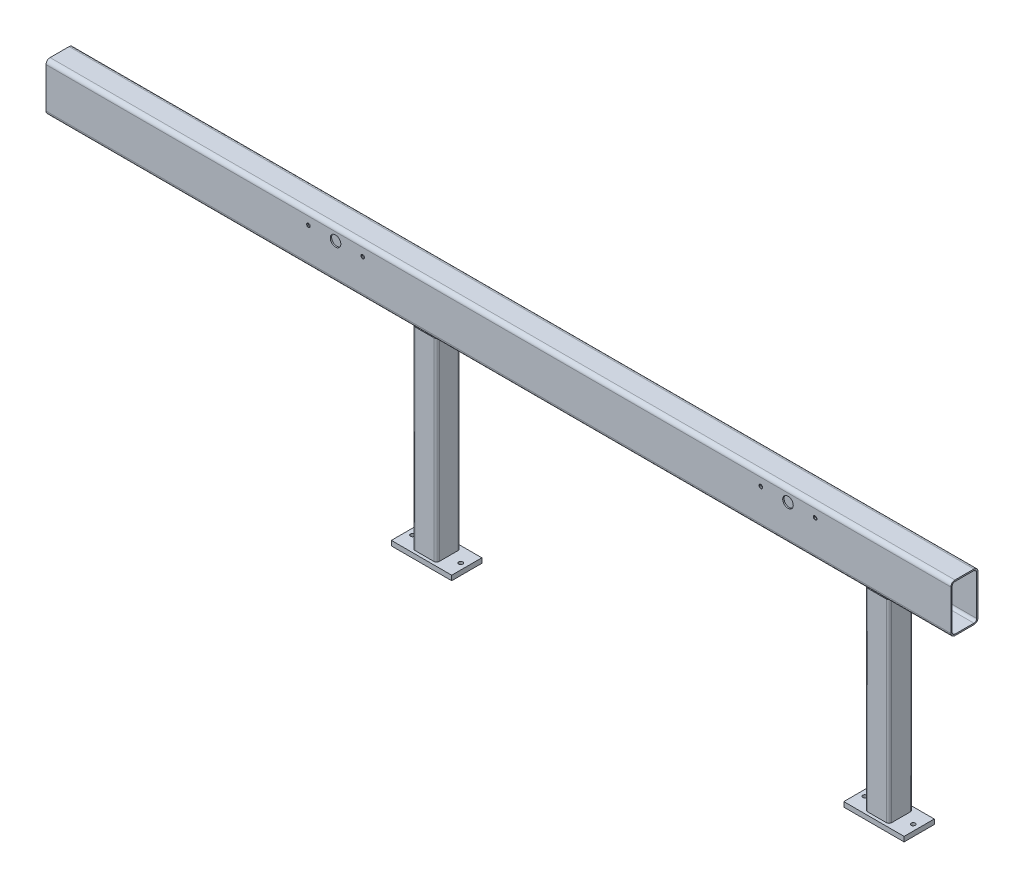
ISO-10303-21;
HEADER;
FILE_DESCRIPTION(('STEP AP214'),'2;1');
FILE_NAME('part.step','',(''),(''),'','','');
FILE_SCHEMA(('AUTOMOTIVE_DESIGN { 1 0 10303 214 1 1 1 1 }'));
ENDSEC;
DATA;
#1=APPLICATION_CONTEXT('core data for automotive mechanical design processes');
#2=APPLICATION_PROTOCOL_DEFINITION('international standard','automotive_design',2000,#1);
#3=PRODUCT_CONTEXT('',#1,'mechanical');
#4=PRODUCT('Part','Part','',(#3));
#5=PRODUCT_RELATED_PRODUCT_CATEGORY('part','',(#4));
#6=PRODUCT_DEFINITION_FORMATION('','',#4);
#7=PRODUCT_DEFINITION_CONTEXT('part definition',#1,'design');
#8=PRODUCT_DEFINITION('design','',#6,#7);
#9=PRODUCT_DEFINITION_SHAPE('','',#8);
#10=(LENGTH_UNIT() NAMED_UNIT(*) SI_UNIT(.MILLI.,.METRE.));
#11=(NAMED_UNIT(*) PLANE_ANGLE_UNIT() SI_UNIT($,.RADIAN.));
#12=(NAMED_UNIT(*) SI_UNIT($,.STERADIAN.) SOLID_ANGLE_UNIT());
#13=UNCERTAINTY_MEASURE_WITH_UNIT(LENGTH_MEASURE(1.E-05),#10,'distance_accuracy_value','');
#14=(GEOMETRIC_REPRESENTATION_CONTEXT(3) GLOBAL_UNCERTAINTY_ASSIGNED_CONTEXT((#13)) GLOBAL_UNIT_ASSIGNED_CONTEXT((#10,
#11,#12)) REPRESENTATION_CONTEXT('',''));
#15=CARTESIAN_POINT('',(0.,0.,0.));
#16=DIRECTION('',(0.,0.,1.));
#17=DIRECTION('',(1.,0.,0.));
#18=AXIS2_PLACEMENT_3D('',#15,#16,#17);
#19=CARTESIAN_POINT('',(-1719.,0.,31.));
#20=DIRECTION('',(0.,-1.,0.));
#21=DIRECTION('',(0.,0.,-1.));
#22=AXIS2_PLACEMENT_3D('',#19,#20,#21);
#23=CYLINDRICAL_SURFACE('',#22,9.00000000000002);
#24=DIRECTION('',(0.,-1.,0.));
#25=VECTOR('',#24,1.);
#26=CARTESIAN_POINT('',(-1719.,0.,40.));
#27=LINE('',#26,#25);
#28=CARTESIAN_POINT('',(-1719.,-80.0000000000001,40.));
#29=VERTEX_POINT('',#28);
#30=CARTESIAN_POINT('',(-1719.,-722.,40.));
#31=VERTEX_POINT('',#30);
#32=EDGE_CURVE('E147',#29,#31,#27,.T.);
#33=ORIENTED_EDGE('',*,*,#32,.T.);
#34=CARTESIAN_POINT('',(-1719.,-722.,31.));
#35=DIRECTION('',(0.,1.,0.));
#36=DIRECTION('',(0.,0.,1.));
#37=AXIS2_PLACEMENT_3D('',#34,#35,#36);
#38=CIRCLE('',#37,9.00000000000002);
#39=CARTESIAN_POINT('',(-1710.,-722.,31.));
#40=VERTEX_POINT('',#39);
#41=EDGE_CURVE('E162',#31,#40,#38,.T.);
#42=ORIENTED_EDGE('',*,*,#41,.T.);
#43=DIRECTION('',(0.,-1.,0.));
#44=VECTOR('',#43,1.);
#45=CARTESIAN_POINT('',(-1710.,0.,31.));
#46=LINE('',#45,#44);
#47=CARTESIAN_POINT('',(-1710.,-80.0000000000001,31.));
#48=VERTEX_POINT('',#47);
#49=EDGE_CURVE('E324',#48,#40,#46,.T.);
#50=ORIENTED_EDGE('',*,*,#49,.F.);
#51=CARTESIAN_POINT('',(-1719.,-80.0000000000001,31.));
#52=DIRECTION('',(0.,1.,0.));
#53=DIRECTION('',(0.,0.,1.));
#54=AXIS2_PLACEMENT_3D('',#51,#52,#53);
#55=CIRCLE('',#54,9.00000000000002);
#56=EDGE_CURVE('E258',#29,#48,#55,.T.);
#57=ORIENTED_EDGE('',*,*,#56,.F.);
#58=EDGE_LOOP('',(#33,#42,#50,#57));
#59=FACE_BOUND('',#58,.T.);
#60=ADVANCED_FACE('F144',(#59),#23,.T.);
#61=CARTESIAN_POINT('',(-1710.,0.,31.));
#62=DIRECTION('',(-1.,0.,0.));
#63=DIRECTION('',(0.,0.,1.));
#64=AXIS2_PLACEMENT_3D('',#61,#62,#63);
#65=PLANE('',#64);
#66=ORIENTED_EDGE('',*,*,#49,.T.);
#67=DIRECTION('',(0.,0.,-1.));
#68=VECTOR('',#67,1.);
#69=CARTESIAN_POINT('',(-1710.,-722.,30.9999999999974));
#70=LINE('',#69,#68);
#71=CARTESIAN_POINT('',(-1710.,-722.,-31.));
#72=VERTEX_POINT('',#71);
#73=EDGE_CURVE('E323',#40,#72,#70,.T.);
#74=ORIENTED_EDGE('',*,*,#73,.T.);
#75=DIRECTION('',(0.,-1.,0.));
#76=VECTOR('',#75,1.);
#77=CARTESIAN_POINT('',(-1710.,0.,-31.));
#78=LINE('',#77,#76);
#79=CARTESIAN_POINT('',(-1710.,-79.9999999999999,-31.));
#80=VERTEX_POINT('',#79);
#81=EDGE_CURVE('E321',#80,#72,#78,.T.);
#82=ORIENTED_EDGE('',*,*,#81,.F.);
#83=DIRECTION('',(0.,0.,-1.));
#84=VECTOR('',#83,1.);
#85=CARTESIAN_POINT('',(-1710.,-80.0000000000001,30.9999999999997));
#86=LINE('',#85,#84);
#87=EDGE_CURVE('E362',#48,#80,#86,.T.);
#88=ORIENTED_EDGE('',*,*,#87,.F.);
#89=EDGE_LOOP('',(#66,#74,#82,#88));
#90=FACE_BOUND('',#89,.T.);
#91=ADVANCED_FACE('F361',(#90),#65,.F.);
#92=CARTESIAN_POINT('',(-1719.,0.,-31.));
#93=DIRECTION('',(0.,-1.,0.));
#94=DIRECTION('',(0.,0.,-1.));
#95=AXIS2_PLACEMENT_3D('',#92,#93,#94);
#96=CYLINDRICAL_SURFACE('',#95,9.00000000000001);
#97=ORIENTED_EDGE('',*,*,#81,.T.);
#98=CARTESIAN_POINT('',(-1719.,-722.,-31.));
#99=DIRECTION('',(0.,1.,0.));
#100=DIRECTION('',(0.,0.,1.));
#101=AXIS2_PLACEMENT_3D('',#98,#99,#100);
#102=CIRCLE('',#101,9.00000000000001);
#103=CARTESIAN_POINT('',(-1719.,-722.,-40.));
#104=VERTEX_POINT('',#103);
#105=EDGE_CURVE('E320',#72,#104,#102,.T.);
#106=ORIENTED_EDGE('',*,*,#105,.T.);
#107=DIRECTION('',(0.,-1.,0.));
#108=VECTOR('',#107,1.);
#109=CARTESIAN_POINT('',(-1719.,0.,-40.));
#110=LINE('',#109,#108);
#111=CARTESIAN_POINT('',(-1719.,-79.9999999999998,-40.));
#112=VERTEX_POINT('',#111);
#113=EDGE_CURVE('E317',#112,#104,#110,.T.);
#114=ORIENTED_EDGE('',*,*,#113,.F.);
#115=CARTESIAN_POINT('',(-1719.,-79.9999999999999,-31.));
#116=DIRECTION('',(0.,1.,0.));
#117=DIRECTION('',(0.,0.,1.));
#118=AXIS2_PLACEMENT_3D('',#115,#116,#117);
#119=CIRCLE('',#118,9.00000000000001);
#120=EDGE_CURVE('E360',#80,#112,#119,.T.);
#121=ORIENTED_EDGE('',*,*,#120,.F.);
#122=EDGE_LOOP('',(#97,#106,#114,#121));
#123=FACE_BOUND('',#122,.T.);
#124=ADVANCED_FACE('F357',(#123),#96,.T.);
#125=CARTESIAN_POINT('',(-1719.,0.,-40.));
#126=DIRECTION('',(0.,0.,1.));
#127=DIRECTION('',(1.,0.,0.));
#128=AXIS2_PLACEMENT_3D('',#125,#126,#127);
#129=PLANE('',#128);
#130=ORIENTED_EDGE('',*,*,#113,.T.);
#131=DIRECTION('',(-1.,0.,0.));
#132=VECTOR('',#131,1.);
#133=CARTESIAN_POINT('',(-1719.,-722.,-40.));
#134=LINE('',#133,#132);
#135=CARTESIAN_POINT('',(-1781.,-722.,-40.));
#136=VERTEX_POINT('',#135);
#137=EDGE_CURVE('E316',#104,#136,#134,.T.);
#138=ORIENTED_EDGE('',*,*,#137,.T.);
#139=DIRECTION('',(0.,-1.,0.));
#140=VECTOR('',#139,1.);
#141=CARTESIAN_POINT('',(-1781.,0.,-40.));
#142=LINE('',#141,#140);
#143=CARTESIAN_POINT('',(-1781.,-79.9999999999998,-40.));
#144=VERTEX_POINT('',#143);
#145=EDGE_CURVE('E313',#144,#136,#142,.T.);
#146=ORIENTED_EDGE('',*,*,#145,.F.);
#147=DIRECTION('',(-1.,0.,0.));
#148=VECTOR('',#147,1.);
#149=CARTESIAN_POINT('',(-1719.,-79.9999999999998,-40.));
#150=LINE('',#149,#148);
#151=EDGE_CURVE('E354',#112,#144,#150,.T.);
#152=ORIENTED_EDGE('',*,*,#151,.F.);
#153=EDGE_LOOP('',(#130,#138,#146,#152));
#154=FACE_BOUND('',#153,.T.);
#155=ADVANCED_FACE('F353',(#154),#129,.F.);
#156=CARTESIAN_POINT('',(-1781.,0.,-31.));
#157=DIRECTION('',(0.,-1.,0.));
#158=DIRECTION('',(0.,0.,-1.));
#159=AXIS2_PLACEMENT_3D('',#156,#157,#158);
#160=CYLINDRICAL_SURFACE('',#159,9.00000000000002);
#161=ORIENTED_EDGE('',*,*,#145,.T.);
#162=CARTESIAN_POINT('',(-1781.,-722.,-31.));
#163=DIRECTION('',(0.,1.,0.));
#164=DIRECTION('',(0.,0.,1.));
#165=AXIS2_PLACEMENT_3D('',#162,#163,#164);
#166=CIRCLE('',#165,9.00000000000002);
#167=CARTESIAN_POINT('',(-1790.,-722.,-31.));
#168=VERTEX_POINT('',#167);
#169=EDGE_CURVE('E312',#136,#168,#166,.T.);
#170=ORIENTED_EDGE('',*,*,#169,.T.);
#171=DIRECTION('',(0.,-1.,0.));
#172=VECTOR('',#171,1.);
#173=CARTESIAN_POINT('',(-1790.,0.,-31.));
#174=LINE('',#173,#172);
#175=CARTESIAN_POINT('',(-1790.,-79.9999999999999,-31.));
#176=VERTEX_POINT('',#175);
#177=EDGE_CURVE('E309',#176,#168,#174,.T.);
#178=ORIENTED_EDGE('',*,*,#177,.F.);
#179=CARTESIAN_POINT('',(-1781.,-79.9999999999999,-31.));
#180=DIRECTION('',(0.,1.,0.));
#181=DIRECTION('',(0.,0.,1.));
#182=AXIS2_PLACEMENT_3D('',#179,#180,#181);
#183=CIRCLE('',#182,9.00000000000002);
#184=EDGE_CURVE('E350',#144,#176,#183,.T.);
#185=ORIENTED_EDGE('',*,*,#184,.F.);
#186=EDGE_LOOP('',(#161,#170,#178,#185));
#187=FACE_BOUND('',#186,.T.);
#188=ADVANCED_FACE('F347',(#187),#160,.T.);
#189=CARTESIAN_POINT('',(-1790.,0.,31.));
#190=DIRECTION('',(1.,0.,0.));
#191=DIRECTION('',(0.,0.,-1.));
#192=AXIS2_PLACEMENT_3D('',#189,#190,#191);
#193=PLANE('',#192);
#194=ORIENTED_EDGE('',*,*,#177,.T.);
#195=DIRECTION('',(0.,0.,1.));
#196=VECTOR('',#195,1.);
#197=CARTESIAN_POINT('',(-1790.,-722.,30.9999999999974));
#198=LINE('',#197,#196);
#199=CARTESIAN_POINT('',(-1790.,-722.,31.));
#200=VERTEX_POINT('',#199);
#201=EDGE_CURVE('E308',#168,#200,#198,.T.);
#202=ORIENTED_EDGE('',*,*,#201,.T.);
#203=DIRECTION('',(0.,-1.,0.));
#204=VECTOR('',#203,1.);
#205=CARTESIAN_POINT('',(-1790.,0.,31.));
#206=LINE('',#205,#204);
#207=CARTESIAN_POINT('',(-1790.,-80.0000000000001,31.));
#208=VERTEX_POINT('',#207);
#209=EDGE_CURVE('E267',#208,#200,#206,.T.);
#210=ORIENTED_EDGE('',*,*,#209,.F.);
#211=DIRECTION('',(0.,0.,1.));
#212=VECTOR('',#211,1.);
#213=CARTESIAN_POINT('',(-1790.,-80.0000000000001,30.9999999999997));
#214=LINE('',#213,#212);
#215=EDGE_CURVE('E610',#176,#208,#214,.T.);
#216=ORIENTED_EDGE('',*,*,#215,.F.);
#217=EDGE_LOOP('',(#194,#202,#210,#216));
#218=FACE_BOUND('',#217,.T.);
#219=ADVANCED_FACE('F343',(#218),#193,.F.);
#220=CARTESIAN_POINT('',(-1781.,0.,31.));
#221=DIRECTION('',(0.,-1.,0.));
#222=DIRECTION('',(0.,0.,-1.));
#223=AXIS2_PLACEMENT_3D('',#220,#221,#222);
#224=CYLINDRICAL_SURFACE('',#223,9.00000000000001);
#225=ORIENTED_EDGE('',*,*,#209,.T.);
#226=CARTESIAN_POINT('',(-1781.,-722.,31.));
#227=DIRECTION('',(0.,1.,0.));
#228=DIRECTION('',(0.,0.,1.));
#229=AXIS2_PLACEMENT_3D('',#226,#227,#228);
#230=CIRCLE('',#229,9.00000000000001);
#231=CARTESIAN_POINT('',(-1781.,-722.,40.));
#232=VERTEX_POINT('',#231);
#233=EDGE_CURVE('E250',#200,#232,#230,.T.);
#234=ORIENTED_EDGE('',*,*,#233,.T.);
#235=DIRECTION('',(0.,-1.,0.));
#236=VECTOR('',#235,1.);
#237=CARTESIAN_POINT('',(-1781.,0.,40.));
#238=LINE('',#237,#236);
#239=CARTESIAN_POINT('',(-1781.,-80.0000000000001,40.));
#240=VERTEX_POINT('',#239);
#241=EDGE_CURVE('E259',#240,#232,#238,.T.);
#242=ORIENTED_EDGE('',*,*,#241,.F.);
#243=CARTESIAN_POINT('',(-1781.,-80.0000000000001,31.));
#244=DIRECTION('',(0.,1.,0.));
#245=DIRECTION('',(0.,0.,1.));
#246=AXIS2_PLACEMENT_3D('',#243,#244,#245);
#247=CIRCLE('',#246,9.00000000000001);
#248=EDGE_CURVE('E387',#208,#240,#247,.T.);
#249=ORIENTED_EDGE('',*,*,#248,.F.);
#250=EDGE_LOOP('',(#225,#234,#242,#249));
#251=FACE_BOUND('',#250,.T.);
#252=ADVANCED_FACE('F264',(#251),#224,.T.);
#253=CARTESIAN_POINT('',(-1719.,0.,31.));
#254=DIRECTION('',(0.,-1.,0.));
#255=DIRECTION('',(0.,0.,-1.));
#256=AXIS2_PLACEMENT_3D('',#253,#254,#255);
#257=CYLINDRICAL_SURFACE('',#256,5.40000000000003);
#258=CARTESIAN_POINT('',(-1719.,-722.,31.));
#259=DIRECTION('',(0.,1.,0.));
#260=DIRECTION('',(0.,0.,1.));
#261=AXIS2_PLACEMENT_3D('',#258,#259,#260);
#262=CIRCLE('',#261,5.40000000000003);
#263=CARTESIAN_POINT('',(-1719.,-722.,36.4));
#264=VERTEX_POINT('',#263);
#265=CARTESIAN_POINT('',(-1713.6,-722.,31.));
#266=VERTEX_POINT('',#265);
#267=EDGE_CURVE('E386',#264,#266,#262,.T.);
#268=ORIENTED_EDGE('',*,*,#267,.F.);
#269=DIRECTION('',(0.,-1.,0.));
#270=VECTOR('',#269,1.);
#271=CARTESIAN_POINT('',(-1719.,0.,36.4));
#272=LINE('',#271,#270);
#273=CARTESIAN_POINT('',(-1719.,-80.0000000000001,36.4));
#274=VERTEX_POINT('',#273);
#275=EDGE_CURVE('E300',#274,#264,#272,.T.);
#276=ORIENTED_EDGE('',*,*,#275,.F.);
#277=CARTESIAN_POINT('',(-1719.,-80.0000000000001,31.));
#278=DIRECTION('',(0.,1.,0.));
#279=DIRECTION('',(0.,0.,1.));
#280=AXIS2_PLACEMENT_3D('',#277,#278,#279);
#281=CIRCLE('',#280,5.40000000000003);
#282=CARTESIAN_POINT('',(-1713.6,-80.0000000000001,31.));
#283=VERTEX_POINT('',#282);
#284=EDGE_CURVE('E268',#274,#283,#281,.T.);
#285=ORIENTED_EDGE('',*,*,#284,.T.);
#286=DIRECTION('',(0.,-1.,0.));
#287=VECTOR('',#286,1.);
#288=CARTESIAN_POINT('',(-1713.6,0.,31.));
#289=LINE('',#288,#287);
#290=EDGE_CURVE('E304',#283,#266,#289,.T.);
#291=ORIENTED_EDGE('',*,*,#290,.T.);
#292=EDGE_LOOP('',(#268,#276,#285,#291));
#293=FACE_BOUND('',#292,.T.);
#294=ADVANCED_FACE('F413',(#293),#257,.F.);
#295=CARTESIAN_POINT('',(-1719.,0.,36.4));
#296=DIRECTION('',(0.,0.,-1.));
#297=DIRECTION('',(-1.,0.,0.));
#298=AXIS2_PLACEMENT_3D('',#295,#296,#297);
#299=PLANE('',#298);
#300=DIRECTION('',(1.,0.,0.));
#301=VECTOR('',#300,1.);
#302=CARTESIAN_POINT('',(-1719.,-722.,36.4));
#303=LINE('',#302,#301);
#304=CARTESIAN_POINT('',(-1781.,-722.,36.4));
#305=VERTEX_POINT('',#304);
#306=EDGE_CURVE('E13',#305,#264,#303,.T.);
#307=ORIENTED_EDGE('',*,*,#306,.F.);
#308=DIRECTION('',(0.,-1.,0.));
#309=VECTOR('',#308,1.);
#310=CARTESIAN_POINT('',(-1781.,0.,36.4));
#311=LINE('',#310,#309);
#312=CARTESIAN_POINT('',(-1781.,-80.0000000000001,36.4));
#313=VERTEX_POINT('',#312);
#314=EDGE_CURVE('E296',#313,#305,#311,.T.);
#315=ORIENTED_EDGE('',*,*,#314,.F.);
#316=DIRECTION('',(1.,0.,0.));
#317=VECTOR('',#316,1.);
#318=CARTESIAN_POINT('',(-1719.,-80.0000000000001,36.4));
#319=LINE('',#318,#317);
#320=EDGE_CURVE('E303',#313,#274,#319,.T.);
#321=ORIENTED_EDGE('',*,*,#320,.T.);
#322=ORIENTED_EDGE('',*,*,#275,.T.);
#323=EDGE_LOOP('',(#307,#315,#321,#322));
#324=FACE_BOUND('',#323,.T.);
#325=ADVANCED_FACE('F416',(#324),#299,.T.);
#326=CARTESIAN_POINT('',(-1781.,0.,31.));
#327=DIRECTION('',(0.,-1.,0.));
#328=DIRECTION('',(0.,0.,-1.));
#329=AXIS2_PLACEMENT_3D('',#326,#327,#328);
#330=CYLINDRICAL_SURFACE('',#329,5.39999999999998);
#331=CARTESIAN_POINT('',(-1781.,-722.,31.));
#332=DIRECTION('',(0.,1.,0.));
#333=DIRECTION('',(0.,0.,1.));
#334=AXIS2_PLACEMENT_3D('',#331,#332,#333);
#335=CIRCLE('',#334,5.39999999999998);
#336=CARTESIAN_POINT('',(-1786.4,-722.,31.));
#337=VERTEX_POINT('',#336);
#338=EDGE_CURVE('E153',#337,#305,#335,.T.);
#339=ORIENTED_EDGE('',*,*,#338,.F.);
#340=DIRECTION('',(0.,-1.,0.));
#341=VECTOR('',#340,1.);
#342=CARTESIAN_POINT('',(-1786.4,0.,31.));
#343=LINE('',#342,#341);
#344=CARTESIAN_POINT('',(-1786.4,-80.0000000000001,31.));
#345=VERTEX_POINT('',#344);
#346=EDGE_CURVE('E292',#345,#337,#343,.T.);
#347=ORIENTED_EDGE('',*,*,#346,.F.);
#348=CARTESIAN_POINT('',(-1781.,-80.0000000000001,31.));
#349=DIRECTION('',(0.,1.,0.));
#350=DIRECTION('',(0.,0.,1.));
#351=AXIS2_PLACEMENT_3D('',#348,#349,#350);
#352=CIRCLE('',#351,5.39999999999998);
#353=EDGE_CURVE('E299',#345,#313,#352,.T.);
#354=ORIENTED_EDGE('',*,*,#353,.T.);
#355=ORIENTED_EDGE('',*,*,#314,.T.);
#356=EDGE_LOOP('',(#339,#347,#354,#355));
#357=FACE_BOUND('',#356,.T.);
#358=ADVANCED_FACE('F421',(#357),#330,.F.);
#359=CARTESIAN_POINT('',(-1786.4,0.,31.));
#360=DIRECTION('',(1.,0.,0.));
#361=DIRECTION('',(0.,0.,-1.));
#362=AXIS2_PLACEMENT_3D('',#359,#360,#361);
#363=PLANE('',#362);
#364=DIRECTION('',(0.,0.,1.));
#365=VECTOR('',#364,1.);
#366=CARTESIAN_POINT('',(-1786.4,-722.,30.9999999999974));
#367=LINE('',#366,#365);
#368=CARTESIAN_POINT('',(-1786.4,-722.,-31.));
#369=VERTEX_POINT('',#368);
#370=EDGE_CURVE('E391',#369,#337,#367,.T.);
#371=ORIENTED_EDGE('',*,*,#370,.F.);
#372=DIRECTION('',(0.,-1.,0.));
#373=VECTOR('',#372,1.);
#374=CARTESIAN_POINT('',(-1786.4,0.,-31.));
#375=LINE('',#374,#373);
#376=CARTESIAN_POINT('',(-1786.4,-79.9999999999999,-31.));
#377=VERTEX_POINT('',#376);
#378=EDGE_CURVE('E288',#377,#369,#375,.T.);
#379=ORIENTED_EDGE('',*,*,#378,.F.);
#380=DIRECTION('',(0.,0.,1.));
#381=VECTOR('',#380,1.);
#382=CARTESIAN_POINT('',(-1786.4,-80.0000000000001,30.9999999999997));
#383=LINE('',#382,#381);
#384=EDGE_CURVE('E295',#377,#345,#383,.T.);
#385=ORIENTED_EDGE('',*,*,#384,.T.);
#386=ORIENTED_EDGE('',*,*,#346,.T.);
#387=EDGE_LOOP('',(#371,#379,#385,#386));
#388=FACE_BOUND('',#387,.T.);
#389=ADVANCED_FACE('F424',(#388),#363,.T.);
#390=CARTESIAN_POINT('',(-1781.,0.,-31.));
#391=DIRECTION('',(0.,-1.,0.));
#392=DIRECTION('',(0.,0.,-1.));
#393=AXIS2_PLACEMENT_3D('',#390,#391,#392);
#394=CYLINDRICAL_SURFACE('',#393,5.40000000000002);
#395=CARTESIAN_POINT('',(-1781.,-722.,-31.));
#396=DIRECTION('',(0.,1.,0.));
#397=DIRECTION('',(0.,0.,1.));
#398=AXIS2_PLACEMENT_3D('',#395,#396,#397);
#399=CIRCLE('',#398,5.40000000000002);
#400=CARTESIAN_POINT('',(-1781.,-722.,-36.4));
#401=VERTEX_POINT('',#400);
#402=EDGE_CURVE('E393',#401,#369,#399,.T.);
#403=ORIENTED_EDGE('',*,*,#402,.F.);
#404=DIRECTION('',(0.,-1.,0.));
#405=VECTOR('',#404,1.);
#406=CARTESIAN_POINT('',(-1781.,0.,-36.4));
#407=LINE('',#406,#405);
#408=CARTESIAN_POINT('',(-1781.,-79.9999999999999,-36.4));
#409=VERTEX_POINT('',#408);
#410=EDGE_CURVE('E284',#409,#401,#407,.T.);
#411=ORIENTED_EDGE('',*,*,#410,.F.);
#412=CARTESIAN_POINT('',(-1781.,-79.9999999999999,-31.));
#413=DIRECTION('',(0.,1.,0.));
#414=DIRECTION('',(0.,0.,1.));
#415=AXIS2_PLACEMENT_3D('',#412,#413,#414);
#416=CIRCLE('',#415,5.40000000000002);
#417=EDGE_CURVE('E291',#409,#377,#416,.T.);
#418=ORIENTED_EDGE('',*,*,#417,.T.);
#419=ORIENTED_EDGE('',*,*,#378,.T.);
#420=EDGE_LOOP('',(#403,#411,#418,#419));
#421=FACE_BOUND('',#420,.T.);
#422=ADVANCED_FACE('F429',(#421),#394,.F.);
#423=CARTESIAN_POINT('',(-1719.,0.,-36.4));
#424=DIRECTION('',(0.,0.,1.));
#425=DIRECTION('',(1.,0.,0.));
#426=AXIS2_PLACEMENT_3D('',#423,#424,#425);
#427=PLANE('',#426);
#428=DIRECTION('',(-1.,0.,0.));
#429=VECTOR('',#428,1.);
#430=CARTESIAN_POINT('',(-1719.,-722.,-36.4));
#431=LINE('',#430,#429);
#432=CARTESIAN_POINT('',(-1719.,-722.,-36.4));
#433=VERTEX_POINT('',#432);
#434=EDGE_CURVE('E395',#433,#401,#431,.T.);
#435=ORIENTED_EDGE('',*,*,#434,.F.);
#436=DIRECTION('',(0.,-1.,0.));
#437=VECTOR('',#436,1.);
#438=CARTESIAN_POINT('',(-1719.,0.,-36.4));
#439=LINE('',#438,#437);
#440=CARTESIAN_POINT('',(-1719.,-79.9999999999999,-36.4));
#441=VERTEX_POINT('',#440);
#442=EDGE_CURVE('E280',#441,#433,#439,.T.);
#443=ORIENTED_EDGE('',*,*,#442,.F.);
#444=DIRECTION('',(-1.,0.,0.));
#445=VECTOR('',#444,1.);
#446=CARTESIAN_POINT('',(-1719.,-79.9999999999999,-36.4));
#447=LINE('',#446,#445);
#448=EDGE_CURVE('E287',#441,#409,#447,.T.);
#449=ORIENTED_EDGE('',*,*,#448,.T.);
#450=ORIENTED_EDGE('',*,*,#410,.T.);
#451=EDGE_LOOP('',(#435,#443,#449,#450));
#452=FACE_BOUND('',#451,.T.);
#453=ADVANCED_FACE('F431',(#452),#427,.T.);
#454=CARTESIAN_POINT('',(-1719.,0.,-31.));
#455=DIRECTION('',(0.,-1.,0.));
#456=DIRECTION('',(0.,0.,-1.));
#457=AXIS2_PLACEMENT_3D('',#454,#455,#456);
#458=CYLINDRICAL_SURFACE('',#457,5.40000000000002);
#459=CARTESIAN_POINT('',(-1719.,-722.,-31.));
#460=DIRECTION('',(0.,1.,0.));
#461=DIRECTION('',(0.,0.,1.));
#462=AXIS2_PLACEMENT_3D('',#459,#460,#461);
#463=CIRCLE('',#462,5.40000000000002);
#464=CARTESIAN_POINT('',(-1713.6,-722.,-31.));
#465=VERTEX_POINT('',#464);
#466=EDGE_CURVE('E396',#465,#433,#463,.T.);
#467=ORIENTED_EDGE('',*,*,#466,.F.);
#468=DIRECTION('',(0.,-1.,0.));
#469=VECTOR('',#468,1.);
#470=CARTESIAN_POINT('',(-1713.6,0.,-31.));
#471=LINE('',#470,#469);
#472=CARTESIAN_POINT('',(-1713.6,-80.,-31.));
#473=VERTEX_POINT('',#472);
#474=EDGE_CURVE('E273',#473,#465,#471,.T.);
#475=ORIENTED_EDGE('',*,*,#474,.F.);
#476=CARTESIAN_POINT('',(-1719.,-79.9999999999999,-31.));
#477=DIRECTION('',(0.,1.,0.));
#478=DIRECTION('',(0.,0.,1.));
#479=AXIS2_PLACEMENT_3D('',#476,#477,#478);
#480=CIRCLE('',#479,5.40000000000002);
#481=EDGE_CURVE('E283',#473,#441,#480,.T.);
#482=ORIENTED_EDGE('',*,*,#481,.T.);
#483=ORIENTED_EDGE('',*,*,#442,.T.);
#484=EDGE_LOOP('',(#467,#475,#482,#483));
#485=FACE_BOUND('',#484,.T.);
#486=ADVANCED_FACE('F406',(#485),#458,.F.);
#487=CARTESIAN_POINT('',(-1713.6,0.,31.));
#488=DIRECTION('',(-1.,0.,0.));
#489=DIRECTION('',(0.,0.,1.));
#490=AXIS2_PLACEMENT_3D('',#487,#488,#489);
#491=PLANE('',#490);
#492=DIRECTION('',(0.,0.,-1.));
#493=VECTOR('',#492,1.);
#494=CARTESIAN_POINT('',(-1713.6,-722.,30.9999999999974));
#495=LINE('',#494,#493);
#496=EDGE_CURVE('E334',#266,#465,#495,.T.);
#497=ORIENTED_EDGE('',*,*,#496,.F.);
#498=ORIENTED_EDGE('',*,*,#290,.F.);
#499=DIRECTION('',(0.,0.,-1.));
#500=VECTOR('',#499,1.);
#501=CARTESIAN_POINT('',(-1713.6,-80.0000000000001,30.9999999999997));
#502=LINE('',#501,#500);
#503=EDGE_CURVE('E276',#283,#473,#502,.T.);
#504=ORIENTED_EDGE('',*,*,#503,.T.);
#505=ORIENTED_EDGE('',*,*,#474,.T.);
#506=EDGE_LOOP('',(#497,#498,#504,#505));
#507=FACE_BOUND('',#506,.T.);
#508=ADVANCED_FACE('F408',(#507),#491,.T.);
#509=CARTESIAN_POINT('',(-1719.,0.,40.));
#510=DIRECTION('',(0.,0.,-1.));
#511=DIRECTION('',(-1.,0.,0.));
#512=AXIS2_PLACEMENT_3D('',#509,#510,#511);
#513=PLANE('',#512);
#514=ORIENTED_EDGE('',*,*,#241,.T.);
#515=DIRECTION('',(1.,0.,0.));
#516=VECTOR('',#515,1.);
#517=CARTESIAN_POINT('',(-1719.,-722.,40.));
#518=LINE('',#517,#516);
#519=EDGE_CURVE('E252',#232,#31,#518,.T.);
#520=ORIENTED_EDGE('',*,*,#519,.T.);
#521=ORIENTED_EDGE('',*,*,#32,.F.);
#522=DIRECTION('',(1.,0.,0.));
#523=VECTOR('',#522,1.);
#524=CARTESIAN_POINT('',(-1719.,-80.0000000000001,40.));
#525=LINE('',#524,#523);
#526=EDGE_CURVE('E272',#240,#29,#525,.T.);
#527=ORIENTED_EDGE('',*,*,#526,.F.);
#528=EDGE_LOOP('',(#514,#520,#521,#527));
#529=FACE_BOUND('',#528,.T.);
#530=ADVANCED_FACE('F271',(#529),#513,.F.);
#531=CARTESIAN_POINT('',(0.,-79.9999999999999,-31.5000000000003));
#532=DIRECTION('',(0.,1.,0.));
#533=DIRECTION('',(0.,0.,1.));
#534=AXIS2_PLACEMENT_3D('',#531,#532,#533);
#535=PLANE('',#534);
#536=ORIENTED_EDGE('',*,*,#320,.F.);
#537=ORIENTED_EDGE('',*,*,#353,.F.);
#538=ORIENTED_EDGE('',*,*,#384,.F.);
#539=ORIENTED_EDGE('',*,*,#417,.F.);
#540=ORIENTED_EDGE('',*,*,#448,.F.);
#541=ORIENTED_EDGE('',*,*,#481,.F.);
#542=ORIENTED_EDGE('',*,*,#503,.F.);
#543=ORIENTED_EDGE('',*,*,#284,.F.);
#544=EDGE_LOOP('',(#536,#537,#538,#539,#540,#541,#542,#543));
#545=FACE_BOUND('',#544,.T.);
#546=ORIENTED_EDGE('',*,*,#56,.T.);
#547=ORIENTED_EDGE('',*,*,#87,.T.);
#548=ORIENTED_EDGE('',*,*,#120,.T.);
#549=ORIENTED_EDGE('',*,*,#151,.T.);
#550=ORIENTED_EDGE('',*,*,#184,.T.);
#551=ORIENTED_EDGE('',*,*,#215,.T.);
#552=ORIENTED_EDGE('',*,*,#248,.T.);
#553=ORIENTED_EDGE('',*,*,#526,.T.);
#554=EDGE_LOOP('',(#546,#547,#548,#549,#550,#551,#552,#553));
#555=FACE_BOUND('',#554,.T.);
#556=ADVANCED_FACE('F410',(#545,#555),#535,.T.);
#557=CARTESIAN_POINT('',(-150.,-722.,50.));
#558=DIRECTION('',(0.,1.,0.));
#559=DIRECTION('',(0.,0.,1.));
#560=AXIS2_PLACEMENT_3D('',#557,#558,#559);
#561=PLANE('',#560);
#562=ORIENTED_EDGE('',*,*,#267,.T.);
#563=ORIENTED_EDGE('',*,*,#496,.T.);
#564=ORIENTED_EDGE('',*,*,#466,.T.);
#565=ORIENTED_EDGE('',*,*,#434,.T.);
#566=ORIENTED_EDGE('',*,*,#402,.T.);
#567=ORIENTED_EDGE('',*,*,#370,.T.);
#568=ORIENTED_EDGE('',*,*,#338,.T.);
#569=ORIENTED_EDGE('',*,*,#306,.T.);
#570=EDGE_LOOP('',(#562,#563,#564,#565,#566,#567,#568,#569));
#571=FACE_BOUND('',#570,.T.);
#572=ORIENTED_EDGE('',*,*,#519,.F.);
#573=ORIENTED_EDGE('',*,*,#233,.F.);
#574=ORIENTED_EDGE('',*,*,#201,.F.);
#575=ORIENTED_EDGE('',*,*,#169,.F.);
#576=ORIENTED_EDGE('',*,*,#137,.F.);
#577=ORIENTED_EDGE('',*,*,#105,.F.);
#578=ORIENTED_EDGE('',*,*,#73,.F.);
#579=ORIENTED_EDGE('',*,*,#41,.F.);
#580=EDGE_LOOP('',(#572,#573,#574,#575,#576,#577,#578,#579));
#581=FACE_BOUND('',#580,.T.);
#582=ADVANCED_FACE('F253',(#571,#581),#561,.F.);
#583=CLOSED_SHELL('',(#60,#91,#124,#155,#188,#219,#252,#294,#325,#358,#389,#422,#453,#486,#508,
#530,#556,#582));
#584=MANIFOLD_SOLID_BREP('B2',#583);
#585=CARTESIAN_POINT('',(-219.,0.,31.));
#586=DIRECTION('',(0.,-1.,0.));
#587=DIRECTION('',(0.,0.,-1.));
#588=AXIS2_PLACEMENT_3D('',#585,#586,#587);
#589=CYLINDRICAL_SURFACE('',#588,9.00000000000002);
#590=DIRECTION('',(0.,-1.,0.));
#591=VECTOR('',#590,1.);
#592=CARTESIAN_POINT('',(-219.,0.,40.));
#593=LINE('',#592,#591);
#594=CARTESIAN_POINT('',(-219.,-80.0000000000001,40.));
#595=VERTEX_POINT('',#594);
#596=CARTESIAN_POINT('',(-219.,-722.,40.));
#597=VERTEX_POINT('',#596);
#598=EDGE_CURVE('E631',#595,#597,#593,.T.);
#599=ORIENTED_EDGE('',*,*,#598,.T.);
#600=CARTESIAN_POINT('',(-219.,-722.,31.));
#601=DIRECTION('',(0.,1.,0.));
#602=DIRECTION('',(0.,0.,1.));
#603=AXIS2_PLACEMENT_3D('',#600,#601,#602);
#604=CIRCLE('',#603,9.00000000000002);
#605=CARTESIAN_POINT('',(-210.,-722.,31.));
#606=VERTEX_POINT('',#605);
#607=EDGE_CURVE('E646',#597,#606,#604,.T.);
#608=ORIENTED_EDGE('',*,*,#607,.T.);
#609=DIRECTION('',(0.,-1.,0.));
#610=VECTOR('',#609,1.);
#611=CARTESIAN_POINT('',(-210.,0.,31.));
#612=LINE('',#611,#610);
#613=CARTESIAN_POINT('',(-210.,-80.0000000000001,31.));
#614=VERTEX_POINT('',#613);
#615=EDGE_CURVE('E808',#614,#606,#612,.T.);
#616=ORIENTED_EDGE('',*,*,#615,.F.);
#617=CARTESIAN_POINT('',(-219.,-80.0000000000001,31.));
#618=DIRECTION('',(0.,1.,0.));
#619=DIRECTION('',(0.,0.,1.));
#620=AXIS2_PLACEMENT_3D('',#617,#618,#619);
#621=CIRCLE('',#620,9.00000000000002);
#622=EDGE_CURVE('E742',#595,#614,#621,.T.);
#623=ORIENTED_EDGE('',*,*,#622,.F.);
#624=EDGE_LOOP('',(#599,#608,#616,#623));
#625=FACE_BOUND('',#624,.T.);
#626=ADVANCED_FACE('F628',(#625),#589,.T.);
#627=CARTESIAN_POINT('',(-210.,0.,31.));
#628=DIRECTION('',(-1.,0.,0.));
#629=DIRECTION('',(0.,0.,1.));
#630=AXIS2_PLACEMENT_3D('',#627,#628,#629);
#631=PLANE('',#630);
#632=ORIENTED_EDGE('',*,*,#615,.T.);
#633=DIRECTION('',(0.,0.,-1.));
#634=VECTOR('',#633,1.);
#635=CARTESIAN_POINT('',(-210.,-722.,30.9999999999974));
#636=LINE('',#635,#634);
#637=CARTESIAN_POINT('',(-210.,-722.,-31.));
#638=VERTEX_POINT('',#637);
#639=EDGE_CURVE('E807',#606,#638,#636,.T.);
#640=ORIENTED_EDGE('',*,*,#639,.T.);
#641=DIRECTION('',(0.,-1.,0.));
#642=VECTOR('',#641,1.);
#643=CARTESIAN_POINT('',(-210.,0.,-31.));
#644=LINE('',#643,#642);
#645=CARTESIAN_POINT('',(-210.,-79.9999999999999,-31.));
#646=VERTEX_POINT('',#645);
#647=EDGE_CURVE('E805',#646,#638,#644,.T.);
#648=ORIENTED_EDGE('',*,*,#647,.F.);
#649=DIRECTION('',(0.,0.,-1.));
#650=VECTOR('',#649,1.);
#651=CARTESIAN_POINT('',(-210.,-80.0000000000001,30.9999999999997));
#652=LINE('',#651,#650);
#653=EDGE_CURVE('E846',#614,#646,#652,.T.);
#654=ORIENTED_EDGE('',*,*,#653,.F.);
#655=EDGE_LOOP('',(#632,#640,#648,#654));
#656=FACE_BOUND('',#655,.T.);
#657=ADVANCED_FACE('F845',(#656),#631,.F.);
#658=CARTESIAN_POINT('',(-219.,0.,-31.));
#659=DIRECTION('',(0.,-1.,0.));
#660=DIRECTION('',(0.,0.,-1.));
#661=AXIS2_PLACEMENT_3D('',#658,#659,#660);
#662=CYLINDRICAL_SURFACE('',#661,9.00000000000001);
#663=ORIENTED_EDGE('',*,*,#647,.T.);
#664=CARTESIAN_POINT('',(-219.,-722.,-31.));
#665=DIRECTION('',(0.,1.,0.));
#666=DIRECTION('',(0.,0.,1.));
#667=AXIS2_PLACEMENT_3D('',#664,#665,#666);
#668=CIRCLE('',#667,9.00000000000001);
#669=CARTESIAN_POINT('',(-219.,-722.,-40.));
#670=VERTEX_POINT('',#669);
#671=EDGE_CURVE('E804',#638,#670,#668,.T.);
#672=ORIENTED_EDGE('',*,*,#671,.T.);
#673=DIRECTION('',(0.,-1.,0.));
#674=VECTOR('',#673,1.);
#675=CARTESIAN_POINT('',(-219.,0.,-40.));
#676=LINE('',#675,#674);
#677=CARTESIAN_POINT('',(-219.,-79.9999999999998,-40.));
#678=VERTEX_POINT('',#677);
#679=EDGE_CURVE('E801',#678,#670,#676,.T.);
#680=ORIENTED_EDGE('',*,*,#679,.F.);
#681=CARTESIAN_POINT('',(-219.,-79.9999999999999,-31.));
#682=DIRECTION('',(0.,1.,0.));
#683=DIRECTION('',(0.,0.,1.));
#684=AXIS2_PLACEMENT_3D('',#681,#682,#683);
#685=CIRCLE('',#684,9.00000000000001);
#686=EDGE_CURVE('E844',#646,#678,#685,.T.);
#687=ORIENTED_EDGE('',*,*,#686,.F.);
#688=EDGE_LOOP('',(#663,#672,#680,#687));
#689=FACE_BOUND('',#688,.T.);
#690=ADVANCED_FACE('F841',(#689),#662,.T.);
#691=CARTESIAN_POINT('',(-219.,0.,-40.));
#692=DIRECTION('',(0.,0.,1.));
#693=DIRECTION('',(1.,0.,0.));
#694=AXIS2_PLACEMENT_3D('',#691,#692,#693);
#695=PLANE('',#694);
#696=ORIENTED_EDGE('',*,*,#679,.T.);
#697=DIRECTION('',(-1.,0.,0.));
#698=VECTOR('',#697,1.);
#699=CARTESIAN_POINT('',(-219.,-722.,-40.));
#700=LINE('',#699,#698);
#701=CARTESIAN_POINT('',(-281.,-722.,-40.));
#702=VERTEX_POINT('',#701);
#703=EDGE_CURVE('E800',#670,#702,#700,.T.);
#704=ORIENTED_EDGE('',*,*,#703,.T.);
#705=DIRECTION('',(0.,-1.,0.));
#706=VECTOR('',#705,1.);
#707=CARTESIAN_POINT('',(-281.,0.,-40.));
#708=LINE('',#707,#706);
#709=CARTESIAN_POINT('',(-281.,-79.9999999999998,-40.));
#710=VERTEX_POINT('',#709);
#711=EDGE_CURVE('E797',#710,#702,#708,.T.);
#712=ORIENTED_EDGE('',*,*,#711,.F.);
#713=DIRECTION('',(-1.,0.,0.));
#714=VECTOR('',#713,1.);
#715=CARTESIAN_POINT('',(-219.,-79.9999999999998,-40.));
#716=LINE('',#715,#714);
#717=EDGE_CURVE('E838',#678,#710,#716,.T.);
#718=ORIENTED_EDGE('',*,*,#717,.F.);
#719=EDGE_LOOP('',(#696,#704,#712,#718));
#720=FACE_BOUND('',#719,.T.);
#721=ADVANCED_FACE('F837',(#720),#695,.F.);
#722=CARTESIAN_POINT('',(-281.,0.,-31.));
#723=DIRECTION('',(0.,-1.,0.));
#724=DIRECTION('',(0.,0.,-1.));
#725=AXIS2_PLACEMENT_3D('',#722,#723,#724);
#726=CYLINDRICAL_SURFACE('',#725,9.00000000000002);
#727=ORIENTED_EDGE('',*,*,#711,.T.);
#728=CARTESIAN_POINT('',(-281.,-722.,-31.));
#729=DIRECTION('',(0.,1.,0.));
#730=DIRECTION('',(0.,0.,1.));
#731=AXIS2_PLACEMENT_3D('',#728,#729,#730);
#732=CIRCLE('',#731,9.00000000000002);
#733=CARTESIAN_POINT('',(-290.,-722.,-31.));
#734=VERTEX_POINT('',#733);
#735=EDGE_CURVE('E796',#702,#734,#732,.T.);
#736=ORIENTED_EDGE('',*,*,#735,.T.);
#737=DIRECTION('',(0.,-1.,0.));
#738=VECTOR('',#737,1.);
#739=CARTESIAN_POINT('',(-290.,0.,-31.));
#740=LINE('',#739,#738);
#741=CARTESIAN_POINT('',(-290.,-79.9999999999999,-31.));
#742=VERTEX_POINT('',#741);
#743=EDGE_CURVE('E793',#742,#734,#740,.T.);
#744=ORIENTED_EDGE('',*,*,#743,.F.);
#745=CARTESIAN_POINT('',(-281.,-79.9999999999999,-31.));
#746=DIRECTION('',(0.,1.,0.));
#747=DIRECTION('',(0.,0.,1.));
#748=AXIS2_PLACEMENT_3D('',#745,#746,#747);
#749=CIRCLE('',#748,9.00000000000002);
#750=EDGE_CURVE('E834',#710,#742,#749,.T.);
#751=ORIENTED_EDGE('',*,*,#750,.F.);
#752=EDGE_LOOP('',(#727,#736,#744,#751));
#753=FACE_BOUND('',#752,.T.);
#754=ADVANCED_FACE('F831',(#753),#726,.T.);
#755=CARTESIAN_POINT('',(-290.,0.,31.));
#756=DIRECTION('',(1.,0.,0.));
#757=DIRECTION('',(0.,0.,-1.));
#758=AXIS2_PLACEMENT_3D('',#755,#756,#757);
#759=PLANE('',#758);
#760=ORIENTED_EDGE('',*,*,#743,.T.);
#761=DIRECTION('',(0.,0.,1.));
#762=VECTOR('',#761,1.);
#763=CARTESIAN_POINT('',(-290.,-722.,30.9999999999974));
#764=LINE('',#763,#762);
#765=CARTESIAN_POINT('',(-290.,-722.,31.));
#766=VERTEX_POINT('',#765);
#767=EDGE_CURVE('E792',#734,#766,#764,.T.);
#768=ORIENTED_EDGE('',*,*,#767,.T.);
#769=DIRECTION('',(0.,-1.,0.));
#770=VECTOR('',#769,1.);
#771=CARTESIAN_POINT('',(-290.,0.,31.));
#772=LINE('',#771,#770);
#773=CARTESIAN_POINT('',(-290.,-80.0000000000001,31.));
#774=VERTEX_POINT('',#773);
#775=EDGE_CURVE('E751',#774,#766,#772,.T.);
#776=ORIENTED_EDGE('',*,*,#775,.F.);
#777=DIRECTION('',(0.,0.,1.));
#778=VECTOR('',#777,1.);
#779=CARTESIAN_POINT('',(-290.,-80.0000000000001,30.9999999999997));
#780=LINE('',#779,#778);
#781=EDGE_CURVE('E1094',#742,#774,#780,.T.);
#782=ORIENTED_EDGE('',*,*,#781,.F.);
#783=EDGE_LOOP('',(#760,#768,#776,#782));
#784=FACE_BOUND('',#783,.T.);
#785=ADVANCED_FACE('F827',(#784),#759,.F.);
#786=CARTESIAN_POINT('',(-281.,0.,31.));
#787=DIRECTION('',(0.,-1.,0.));
#788=DIRECTION('',(0.,0.,-1.));
#789=AXIS2_PLACEMENT_3D('',#786,#787,#788);
#790=CYLINDRICAL_SURFACE('',#789,9.00000000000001);
#791=ORIENTED_EDGE('',*,*,#775,.T.);
#792=CARTESIAN_POINT('',(-281.,-722.,31.));
#793=DIRECTION('',(0.,1.,0.));
#794=DIRECTION('',(0.,0.,1.));
#795=AXIS2_PLACEMENT_3D('',#792,#793,#794);
#796=CIRCLE('',#795,9.00000000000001);
#797=CARTESIAN_POINT('',(-281.,-722.,40.));
#798=VERTEX_POINT('',#797);
#799=EDGE_CURVE('E734',#766,#798,#796,.T.);
#800=ORIENTED_EDGE('',*,*,#799,.T.);
#801=DIRECTION('',(0.,-1.,0.));
#802=VECTOR('',#801,1.);
#803=CARTESIAN_POINT('',(-281.,0.,40.));
#804=LINE('',#803,#802);
#805=CARTESIAN_POINT('',(-281.,-80.0000000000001,40.));
#806=VERTEX_POINT('',#805);
#807=EDGE_CURVE('E743',#806,#798,#804,.T.);
#808=ORIENTED_EDGE('',*,*,#807,.F.);
#809=CARTESIAN_POINT('',(-281.,-80.0000000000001,31.));
#810=DIRECTION('',(0.,1.,0.));
#811=DIRECTION('',(0.,0.,1.));
#812=AXIS2_PLACEMENT_3D('',#809,#810,#811);
#813=CIRCLE('',#812,9.00000000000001);
#814=EDGE_CURVE('E871',#774,#806,#813,.T.);
#815=ORIENTED_EDGE('',*,*,#814,.F.);
#816=EDGE_LOOP('',(#791,#800,#808,#815));
#817=FACE_BOUND('',#816,.T.);
#818=ADVANCED_FACE('F748',(#817),#790,.T.);
#819=CARTESIAN_POINT('',(-219.,0.,31.));
#820=DIRECTION('',(0.,-1.,0.));
#821=DIRECTION('',(0.,0.,-1.));
#822=AXIS2_PLACEMENT_3D('',#819,#820,#821);
#823=CYLINDRICAL_SURFACE('',#822,5.40000000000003);
#824=CARTESIAN_POINT('',(-219.,-722.,31.));
#825=DIRECTION('',(0.,1.,0.));
#826=DIRECTION('',(0.,0.,1.));
#827=AXIS2_PLACEMENT_3D('',#824,#825,#826);
#828=CIRCLE('',#827,5.40000000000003);
#829=CARTESIAN_POINT('',(-219.,-722.,36.4));
#830=VERTEX_POINT('',#829);
#831=CARTESIAN_POINT('',(-213.6,-722.,31.));
#832=VERTEX_POINT('',#831);
#833=EDGE_CURVE('E870',#830,#832,#828,.T.);
#834=ORIENTED_EDGE('',*,*,#833,.F.);
#835=DIRECTION('',(0.,-1.,0.));
#836=VECTOR('',#835,1.);
#837=CARTESIAN_POINT('',(-219.,0.,36.4));
#838=LINE('',#837,#836);
#839=CARTESIAN_POINT('',(-219.,-80.0000000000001,36.4));
#840=VERTEX_POINT('',#839);
#841=EDGE_CURVE('E784',#840,#830,#838,.T.);
#842=ORIENTED_EDGE('',*,*,#841,.F.);
#843=CARTESIAN_POINT('',(-219.,-80.0000000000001,31.));
#844=DIRECTION('',(0.,1.,0.));
#845=DIRECTION('',(0.,0.,1.));
#846=AXIS2_PLACEMENT_3D('',#843,#844,#845);
#847=CIRCLE('',#846,5.40000000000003);
#848=CARTESIAN_POINT('',(-213.6,-80.0000000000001,31.));
#849=VERTEX_POINT('',#848);
#850=EDGE_CURVE('E752',#840,#849,#847,.T.);
#851=ORIENTED_EDGE('',*,*,#850,.T.);
#852=DIRECTION('',(0.,-1.,0.));
#853=VECTOR('',#852,1.);
#854=CARTESIAN_POINT('',(-213.6,0.,31.));
#855=LINE('',#854,#853);
#856=EDGE_CURVE('E788',#849,#832,#855,.T.);
#857=ORIENTED_EDGE('',*,*,#856,.T.);
#858=EDGE_LOOP('',(#834,#842,#851,#857));
#859=FACE_BOUND('',#858,.T.);
#860=ADVANCED_FACE('F897',(#859),#823,.F.);
#861=CARTESIAN_POINT('',(-219.,0.,36.4));
#862=DIRECTION('',(0.,0.,-1.));
#863=DIRECTION('',(-1.,0.,0.));
#864=AXIS2_PLACEMENT_3D('',#861,#862,#863);
#865=PLANE('',#864);
#866=DIRECTION('',(1.,0.,0.));
#867=VECTOR('',#866,1.);
#868=CARTESIAN_POINT('',(-219.,-722.,36.4));
#869=LINE('',#868,#867);
#870=CARTESIAN_POINT('',(-281.,-722.,36.4));
#871=VERTEX_POINT('',#870);
#872=EDGE_CURVE('E142',#871,#830,#869,.T.);
#873=ORIENTED_EDGE('',*,*,#872,.F.);
#874=DIRECTION('',(0.,-1.,0.));
#875=VECTOR('',#874,1.);
#876=CARTESIAN_POINT('',(-281.,0.,36.4));
#877=LINE('',#876,#875);
#878=CARTESIAN_POINT('',(-281.,-80.0000000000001,36.4));
#879=VERTEX_POINT('',#878);
#880=EDGE_CURVE('E780',#879,#871,#877,.T.);
#881=ORIENTED_EDGE('',*,*,#880,.F.);
#882=DIRECTION('',(1.,0.,0.));
#883=VECTOR('',#882,1.);
#884=CARTESIAN_POINT('',(-219.,-80.0000000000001,36.4));
#885=LINE('',#884,#883);
#886=EDGE_CURVE('E787',#879,#840,#885,.T.);
#887=ORIENTED_EDGE('',*,*,#886,.T.);
#888=ORIENTED_EDGE('',*,*,#841,.T.);
#889=EDGE_LOOP('',(#873,#881,#887,#888));
#890=FACE_BOUND('',#889,.T.);
#891=ADVANCED_FACE('F900',(#890),#865,.T.);
#892=CARTESIAN_POINT('',(-281.,0.,31.));
#893=DIRECTION('',(0.,-1.,0.));
#894=DIRECTION('',(0.,0.,-1.));
#895=AXIS2_PLACEMENT_3D('',#892,#893,#894);
#896=CYLINDRICAL_SURFACE('',#895,5.39999999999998);
#897=CARTESIAN_POINT('',(-281.,-722.,31.));
#898=DIRECTION('',(0.,1.,0.));
#899=DIRECTION('',(0.,0.,1.));
#900=AXIS2_PLACEMENT_3D('',#897,#898,#899);
#901=CIRCLE('',#900,5.39999999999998);
#902=CARTESIAN_POINT('',(-286.4,-722.,31.));
#903=VERTEX_POINT('',#902);
#904=EDGE_CURVE('E637',#903,#871,#901,.T.);
#905=ORIENTED_EDGE('',*,*,#904,.F.);
#906=DIRECTION('',(0.,-1.,0.));
#907=VECTOR('',#906,1.);
#908=CARTESIAN_POINT('',(-286.4,0.,31.));
#909=LINE('',#908,#907);
#910=CARTESIAN_POINT('',(-286.4,-80.0000000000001,31.));
#911=VERTEX_POINT('',#910);
#912=EDGE_CURVE('E776',#911,#903,#909,.T.);
#913=ORIENTED_EDGE('',*,*,#912,.F.);
#914=CARTESIAN_POINT('',(-281.,-80.0000000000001,31.));
#915=DIRECTION('',(0.,1.,0.));
#916=DIRECTION('',(0.,0.,1.));
#917=AXIS2_PLACEMENT_3D('',#914,#915,#916);
#918=CIRCLE('',#917,5.39999999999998);
#919=EDGE_CURVE('E783',#911,#879,#918,.T.);
#920=ORIENTED_EDGE('',*,*,#919,.T.);
#921=ORIENTED_EDGE('',*,*,#880,.T.);
#922=EDGE_LOOP('',(#905,#913,#920,#921));
#923=FACE_BOUND('',#922,.T.);
#924=ADVANCED_FACE('F905',(#923),#896,.F.);
#925=CARTESIAN_POINT('',(-286.4,0.,31.));
#926=DIRECTION('',(1.,0.,0.));
#927=DIRECTION('',(0.,0.,-1.));
#928=AXIS2_PLACEMENT_3D('',#925,#926,#927);
#929=PLANE('',#928);
#930=DIRECTION('',(0.,0.,1.));
#931=VECTOR('',#930,1.);
#932=CARTESIAN_POINT('',(-286.4,-722.,30.9999999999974));
#933=LINE('',#932,#931);
#934=CARTESIAN_POINT('',(-286.4,-722.,-31.));
#935=VERTEX_POINT('',#934);
#936=EDGE_CURVE('E875',#935,#903,#933,.T.);
#937=ORIENTED_EDGE('',*,*,#936,.F.);
#938=DIRECTION('',(0.,-1.,0.));
#939=VECTOR('',#938,1.);
#940=CARTESIAN_POINT('',(-286.4,0.,-31.));
#941=LINE('',#940,#939);
#942=CARTESIAN_POINT('',(-286.4,-79.9999999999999,-31.));
#943=VERTEX_POINT('',#942);
#944=EDGE_CURVE('E772',#943,#935,#941,.T.);
#945=ORIENTED_EDGE('',*,*,#944,.F.);
#946=DIRECTION('',(0.,0.,1.));
#947=VECTOR('',#946,1.);
#948=CARTESIAN_POINT('',(-286.4,-80.0000000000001,30.9999999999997));
#949=LINE('',#948,#947);
#950=EDGE_CURVE('E779',#943,#911,#949,.T.);
#951=ORIENTED_EDGE('',*,*,#950,.T.);
#952=ORIENTED_EDGE('',*,*,#912,.T.);
#953=EDGE_LOOP('',(#937,#945,#951,#952));
#954=FACE_BOUND('',#953,.T.);
#955=ADVANCED_FACE('F908',(#954),#929,.T.);
#956=CARTESIAN_POINT('',(-281.,0.,-31.));
#957=DIRECTION('',(0.,-1.,0.));
#958=DIRECTION('',(0.,0.,-1.));
#959=AXIS2_PLACEMENT_3D('',#956,#957,#958);
#960=CYLINDRICAL_SURFACE('',#959,5.40000000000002);
#961=CARTESIAN_POINT('',(-281.,-722.,-31.));
#962=DIRECTION('',(0.,1.,0.));
#963=DIRECTION('',(0.,0.,1.));
#964=AXIS2_PLACEMENT_3D('',#961,#962,#963);
#965=CIRCLE('',#964,5.40000000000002);
#966=CARTESIAN_POINT('',(-281.,-722.,-36.4));
#967=VERTEX_POINT('',#966);
#968=EDGE_CURVE('E877',#967,#935,#965,.T.);
#969=ORIENTED_EDGE('',*,*,#968,.F.);
#970=DIRECTION('',(0.,-1.,0.));
#971=VECTOR('',#970,1.);
#972=CARTESIAN_POINT('',(-281.,0.,-36.4));
#973=LINE('',#972,#971);
#974=CARTESIAN_POINT('',(-281.,-79.9999999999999,-36.4));
#975=VERTEX_POINT('',#974);
#976=EDGE_CURVE('E768',#975,#967,#973,.T.);
#977=ORIENTED_EDGE('',*,*,#976,.F.);
#978=CARTESIAN_POINT('',(-281.,-79.9999999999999,-31.));
#979=DIRECTION('',(0.,1.,0.));
#980=DIRECTION('',(0.,0.,1.));
#981=AXIS2_PLACEMENT_3D('',#978,#979,#980);
#982=CIRCLE('',#981,5.40000000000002);
#983=EDGE_CURVE('E775',#975,#943,#982,.T.);
#984=ORIENTED_EDGE('',*,*,#983,.T.);
#985=ORIENTED_EDGE('',*,*,#944,.T.);
#986=EDGE_LOOP('',(#969,#977,#984,#985));
#987=FACE_BOUND('',#986,.T.);
#988=ADVANCED_FACE('F913',(#987),#960,.F.);
#989=CARTESIAN_POINT('',(-219.,0.,-36.4));
#990=DIRECTION('',(0.,0.,1.));
#991=DIRECTION('',(1.,0.,0.));
#992=AXIS2_PLACEMENT_3D('',#989,#990,#991);
#993=PLANE('',#992);
#994=DIRECTION('',(-1.,0.,0.));
#995=VECTOR('',#994,1.);
#996=CARTESIAN_POINT('',(-219.,-722.,-36.4));
#997=LINE('',#996,#995);
#998=CARTESIAN_POINT('',(-219.,-722.,-36.4));
#999=VERTEX_POINT('',#998);
#1000=EDGE_CURVE('E879',#999,#967,#997,.T.);
#1001=ORIENTED_EDGE('',*,*,#1000,.F.);
#1002=DIRECTION('',(0.,-1.,0.));
#1003=VECTOR('',#1002,1.);
#1004=CARTESIAN_POINT('',(-219.,0.,-36.4));
#1005=LINE('',#1004,#1003);
#1006=CARTESIAN_POINT('',(-219.,-79.9999999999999,-36.4));
#1007=VERTEX_POINT('',#1006);
#1008=EDGE_CURVE('E764',#1007,#999,#1005,.T.);
#1009=ORIENTED_EDGE('',*,*,#1008,.F.);
#1010=DIRECTION('',(-1.,0.,0.));
#1011=VECTOR('',#1010,1.);
#1012=CARTESIAN_POINT('',(-219.,-79.9999999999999,-36.4));
#1013=LINE('',#1012,#1011);
#1014=EDGE_CURVE('E771',#1007,#975,#1013,.T.);
#1015=ORIENTED_EDGE('',*,*,#1014,.T.);
#1016=ORIENTED_EDGE('',*,*,#976,.T.);
#1017=EDGE_LOOP('',(#1001,#1009,#1015,#1016));
#1018=FACE_BOUND('',#1017,.T.);
#1019=ADVANCED_FACE('F915',(#1018),#993,.T.);
#1020=CARTESIAN_POINT('',(-219.,0.,-31.));
#1021=DIRECTION('',(0.,-1.,0.));
#1022=DIRECTION('',(0.,0.,-1.));
#1023=AXIS2_PLACEMENT_3D('',#1020,#1021,#1022);
#1024=CYLINDRICAL_SURFACE('',#1023,5.40000000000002);
#1025=CARTESIAN_POINT('',(-219.,-722.,-31.));
#1026=DIRECTION('',(0.,1.,0.));
#1027=DIRECTION('',(0.,0.,1.));
#1028=AXIS2_PLACEMENT_3D('',#1025,#1026,#1027);
#1029=CIRCLE('',#1028,5.40000000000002);
#1030=CARTESIAN_POINT('',(-213.6,-722.,-31.));
#1031=VERTEX_POINT('',#1030);
#1032=EDGE_CURVE('E880',#1031,#999,#1029,.T.);
#1033=ORIENTED_EDGE('',*,*,#1032,.F.);
#1034=DIRECTION('',(0.,-1.,0.));
#1035=VECTOR('',#1034,1.);
#1036=CARTESIAN_POINT('',(-213.6,0.,-31.));
#1037=LINE('',#1036,#1035);
#1038=CARTESIAN_POINT('',(-213.6,-80.,-31.));
#1039=VERTEX_POINT('',#1038);
#1040=EDGE_CURVE('E757',#1039,#1031,#1037,.T.);
#1041=ORIENTED_EDGE('',*,*,#1040,.F.);
#1042=CARTESIAN_POINT('',(-219.,-79.9999999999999,-31.));
#1043=DIRECTION('',(0.,1.,0.));
#1044=DIRECTION('',(0.,0.,1.));
#1045=AXIS2_PLACEMENT_3D('',#1042,#1043,#1044);
#1046=CIRCLE('',#1045,5.40000000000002);
#1047=EDGE_CURVE('E767',#1039,#1007,#1046,.T.);
#1048=ORIENTED_EDGE('',*,*,#1047,.T.);
#1049=ORIENTED_EDGE('',*,*,#1008,.T.);
#1050=EDGE_LOOP('',(#1033,#1041,#1048,#1049));
#1051=FACE_BOUND('',#1050,.T.);
#1052=ADVANCED_FACE('F890',(#1051),#1024,.F.);
#1053=CARTESIAN_POINT('',(-213.6,0.,31.));
#1054=DIRECTION('',(-1.,0.,0.));
#1055=DIRECTION('',(0.,0.,1.));
#1056=AXIS2_PLACEMENT_3D('',#1053,#1054,#1055);
#1057=PLANE('',#1056);
#1058=DIRECTION('',(0.,0.,-1.));
#1059=VECTOR('',#1058,1.);
#1060=CARTESIAN_POINT('',(-213.6,-722.,30.9999999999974));
#1061=LINE('',#1060,#1059);
#1062=EDGE_CURVE('E818',#832,#1031,#1061,.T.);
#1063=ORIENTED_EDGE('',*,*,#1062,.F.);
#1064=ORIENTED_EDGE('',*,*,#856,.F.);
#1065=DIRECTION('',(0.,0.,-1.));
#1066=VECTOR('',#1065,1.);
#1067=CARTESIAN_POINT('',(-213.6,-80.0000000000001,30.9999999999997));
#1068=LINE('',#1067,#1066);
#1069=EDGE_CURVE('E760',#849,#1039,#1068,.T.);
#1070=ORIENTED_EDGE('',*,*,#1069,.T.);
#1071=ORIENTED_EDGE('',*,*,#1040,.T.);
#1072=EDGE_LOOP('',(#1063,#1064,#1070,#1071));
#1073=FACE_BOUND('',#1072,.T.);
#1074=ADVANCED_FACE('F892',(#1073),#1057,.T.);
#1075=CARTESIAN_POINT('',(-219.,0.,40.));
#1076=DIRECTION('',(0.,0.,-1.));
#1077=DIRECTION('',(-1.,0.,0.));
#1078=AXIS2_PLACEMENT_3D('',#1075,#1076,#1077);
#1079=PLANE('',#1078);
#1080=ORIENTED_EDGE('',*,*,#807,.T.);
#1081=DIRECTION('',(1.,0.,0.));
#1082=VECTOR('',#1081,1.);
#1083=CARTESIAN_POINT('',(-219.,-722.,40.));
#1084=LINE('',#1083,#1082);
#1085=EDGE_CURVE('E736',#798,#597,#1084,.T.);
#1086=ORIENTED_EDGE('',*,*,#1085,.T.);
#1087=ORIENTED_EDGE('',*,*,#598,.F.);
#1088=DIRECTION('',(1.,0.,0.));
#1089=VECTOR('',#1088,1.);
#1090=CARTESIAN_POINT('',(-219.,-80.0000000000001,40.));
#1091=LINE('',#1090,#1089);
#1092=EDGE_CURVE('E756',#806,#595,#1091,.T.);
#1093=ORIENTED_EDGE('',*,*,#1092,.F.);
#1094=EDGE_LOOP('',(#1080,#1086,#1087,#1093));
#1095=FACE_BOUND('',#1094,.T.);
#1096=ADVANCED_FACE('F755',(#1095),#1079,.F.);
#1097=CARTESIAN_POINT('',(0.,-79.9999999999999,-31.5000000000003));
#1098=DIRECTION('',(0.,1.,0.));
#1099=DIRECTION('',(0.,0.,1.));
#1100=AXIS2_PLACEMENT_3D('',#1097,#1098,#1099);
#1101=PLANE('',#1100);
#1102=ORIENTED_EDGE('',*,*,#886,.F.);
#1103=ORIENTED_EDGE('',*,*,#919,.F.);
#1104=ORIENTED_EDGE('',*,*,#950,.F.);
#1105=ORIENTED_EDGE('',*,*,#983,.F.);
#1106=ORIENTED_EDGE('',*,*,#1014,.F.);
#1107=ORIENTED_EDGE('',*,*,#1047,.F.);
#1108=ORIENTED_EDGE('',*,*,#1069,.F.);
#1109=ORIENTED_EDGE('',*,*,#850,.F.);
#1110=EDGE_LOOP('',(#1102,#1103,#1104,#1105,#1106,#1107,#1108,#1109));
#1111=FACE_BOUND('',#1110,.T.);
#1112=ORIENTED_EDGE('',*,*,#622,.T.);
#1113=ORIENTED_EDGE('',*,*,#653,.T.);
#1114=ORIENTED_EDGE('',*,*,#686,.T.);
#1115=ORIENTED_EDGE('',*,*,#717,.T.);
#1116=ORIENTED_EDGE('',*,*,#750,.T.);
#1117=ORIENTED_EDGE('',*,*,#781,.T.);
#1118=ORIENTED_EDGE('',*,*,#814,.T.);
#1119=ORIENTED_EDGE('',*,*,#1092,.T.);
#1120=EDGE_LOOP('',(#1112,#1113,#1114,#1115,#1116,#1117,#1118,#1119));
#1121=FACE_BOUND('',#1120,.T.);
#1122=ADVANCED_FACE('F894',(#1111,#1121),#1101,.T.);
#1123=CARTESIAN_POINT('',(-150.,-722.,50.));
#1124=DIRECTION('',(0.,1.,0.));
#1125=DIRECTION('',(0.,0.,1.));
#1126=AXIS2_PLACEMENT_3D('',#1123,#1124,#1125);
#1127=PLANE('',#1126);
#1128=ORIENTED_EDGE('',*,*,#833,.T.);
#1129=ORIENTED_EDGE('',*,*,#1062,.T.);
#1130=ORIENTED_EDGE('',*,*,#1032,.T.);
#1131=ORIENTED_EDGE('',*,*,#1000,.T.);
#1132=ORIENTED_EDGE('',*,*,#968,.T.);
#1133=ORIENTED_EDGE('',*,*,#936,.T.);
#1134=ORIENTED_EDGE('',*,*,#904,.T.);
#1135=ORIENTED_EDGE('',*,*,#872,.T.);
#1136=EDGE_LOOP('',(#1128,#1129,#1130,#1131,#1132,#1133,#1134,#1135));
#1137=FACE_BOUND('',#1136,.T.);
#1138=ORIENTED_EDGE('',*,*,#1085,.F.);
#1139=ORIENTED_EDGE('',*,*,#799,.F.);
#1140=ORIENTED_EDGE('',*,*,#767,.F.);
#1141=ORIENTED_EDGE('',*,*,#735,.F.);
#1142=ORIENTED_EDGE('',*,*,#703,.F.);
#1143=ORIENTED_EDGE('',*,*,#671,.F.);
#1144=ORIENTED_EDGE('',*,*,#639,.F.);
#1145=ORIENTED_EDGE('',*,*,#607,.F.);
#1146=EDGE_LOOP('',(#1138,#1139,#1140,#1141,#1142,#1143,#1144,#1145));
#1147=FACE_BOUND('',#1146,.T.);
#1148=ADVANCED_FACE('F737',(#1137,#1147),#1127,.F.);
#1149=CLOSED_SHELL('',(#626,#657,#690,#721,#754,#785,#818,#860,#891,#924,#955,#988,#1019,#1052,
#1074,#1096,#1122,#1148));
#1150=MANIFOLD_SOLID_BREP('B7',#1149);
#1151=CARTESIAN_POINT('',(-1650.,-738.,50.));
#1152=DIRECTION('',(0.,0.,1.));
#1153=DIRECTION('',(0.,-1.,0.));
#1154=AXIS2_PLACEMENT_3D('',#1151,#1152,#1153);
#1155=PLANE('',#1154);
#1156=DIRECTION('',(0.,1.,0.));
#1157=VECTOR('',#1156,1.);
#1158=CARTESIAN_POINT('',(-1850.,-738.,50.));
#1159=LINE('',#1158,#1157);
#1160=CARTESIAN_POINT('',(-1850.,-738.,50.));
#1161=VERTEX_POINT('',#1160);
#1162=CARTESIAN_POINT('',(-1850.,-722.,50.));
#1163=VERTEX_POINT('',#1162);
#1164=EDGE_CURVE('E1175',#1161,#1163,#1159,.T.);
#1165=ORIENTED_EDGE('',*,*,#1164,.F.);
#1166=DIRECTION('',(-1.,0.,0.));
#1167=VECTOR('',#1166,1.);
#1168=CARTESIAN_POINT('',(-1650.,-738.,50.));
#1169=LINE('',#1168,#1167);
#1170=CARTESIAN_POINT('',(-1650.,-738.,50.));
#1171=VERTEX_POINT('',#1170);
#1172=EDGE_CURVE('E626',#1171,#1161,#1169,.T.);
#1173=ORIENTED_EDGE('',*,*,#1172,.F.);
#1174=DIRECTION('',(0.,1.,0.));
#1175=VECTOR('',#1174,1.);
#1176=CARTESIAN_POINT('',(-1650.,-738.,50.));
#1177=LINE('',#1176,#1175);
#1178=CARTESIAN_POINT('',(-1650.,-722.,50.));
#1179=VERTEX_POINT('',#1178);
#1180=EDGE_CURVE('E1160',#1171,#1179,#1177,.T.);
#1181=ORIENTED_EDGE('',*,*,#1180,.T.);
#1182=DIRECTION('',(-1.,0.,0.));
#1183=VECTOR('',#1182,1.);
#1184=CARTESIAN_POINT('',(-1650.,-722.,50.));
#1185=LINE('',#1184,#1183);
#1186=EDGE_CURVE('E1128',#1179,#1163,#1185,.T.);
#1187=ORIENTED_EDGE('',*,*,#1186,.T.);
#1188=EDGE_LOOP('',(#1165,#1173,#1181,#1187));
#1189=FACE_BOUND('',#1188,.T.);
#1190=ADVANCED_FACE('F1112',(#1189),#1155,.T.);
#1191=CARTESIAN_POINT('',(-1650.,-738.,50.));
#1192=DIRECTION('',(0.,1.,0.));
#1193=DIRECTION('',(0.,0.,1.));
#1194=AXIS2_PLACEMENT_3D('',#1191,#1192,#1193);
#1195=PLANE('',#1194);
#1196=CARTESIAN_POINT('',(-1670.,-738.,0.));
#1197=DIRECTION('',(0.,-1.,0.));
#1198=DIRECTION('',(0.,0.,-1.));
#1199=AXIS2_PLACEMENT_3D('',#1196,#1197,#1198);
#1200=CIRCLE('',#1199,6.74999999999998);
#1201=CARTESIAN_POINT('',(-1670.,-738.,-6.74999999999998));
#1202=VERTEX_POINT('',#1201);
#1203=EDGE_CURVE('E1195',#1202,#1202,#1200,.T.);
#1204=ORIENTED_EDGE('',*,*,#1203,.F.);
#1205=EDGE_LOOP('',(#1204));
#1206=FACE_BOUND('',#1205,.T.);
#1207=CARTESIAN_POINT('',(-1830.,-738.,0.));
#1208=DIRECTION('',(0.,-1.,0.));
#1209=DIRECTION('',(0.,0.,-1.));
#1210=AXIS2_PLACEMENT_3D('',#1207,#1208,#1209);
#1211=CIRCLE('',#1210,6.74999999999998);
#1212=CARTESIAN_POINT('',(-1830.,-738.,-6.75000000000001));
#1213=VERTEX_POINT('',#1212);
#1214=EDGE_CURVE('E1189',#1213,#1213,#1211,.T.);
#1215=ORIENTED_EDGE('',*,*,#1214,.F.);
#1216=EDGE_LOOP('',(#1215));
#1217=FACE_BOUND('',#1216,.T.);
#1218=DIRECTION('',(0.,0.,-1.));
#1219=VECTOR('',#1218,1.);
#1220=CARTESIAN_POINT('',(-1850.,-738.,50.));
#1221=LINE('',#1220,#1219);
#1222=CARTESIAN_POINT('',(-1850.,-738.,-50.));
#1223=VERTEX_POINT('',#1222);
#1224=EDGE_CURVE('E1166',#1161,#1223,#1221,.T.);
#1225=ORIENTED_EDGE('',*,*,#1224,.T.);
#1226=DIRECTION('',(-1.,0.,0.));
#1227=VECTOR('',#1226,1.);
#1228=CARTESIAN_POINT('',(-1650.,-738.,-50.));
#1229=LINE('',#1228,#1227);
#1230=CARTESIAN_POINT('',(-1650.,-738.,-50.));
#1231=VERTEX_POINT('',#1230);
#1232=EDGE_CURVE('E1120',#1231,#1223,#1229,.T.);
#1233=ORIENTED_EDGE('',*,*,#1232,.F.);
#1234=DIRECTION('',(0.,0.,-1.));
#1235=VECTOR('',#1234,1.);
#1236=CARTESIAN_POINT('',(-1650.,-738.,50.));
#1237=LINE('',#1236,#1235);
#1238=EDGE_CURVE('E1154',#1171,#1231,#1237,.T.);
#1239=ORIENTED_EDGE('',*,*,#1238,.F.);
#1240=ORIENTED_EDGE('',*,*,#1172,.T.);
#1241=EDGE_LOOP('',(#1225,#1233,#1239,#1240));
#1242=FACE_BOUND('',#1241,.T.);
#1243=ADVANCED_FACE('F1164',(#1206,#1217,#1242),#1195,.F.);
#1244=CARTESIAN_POINT('',(-1650.,-738.,-50.));
#1245=DIRECTION('',(0.,0.,1.));
#1246=DIRECTION('',(0.,-1.,0.));
#1247=AXIS2_PLACEMENT_3D('',#1244,#1245,#1246);
#1248=PLANE('',#1247);
#1249=DIRECTION('',(0.,1.,0.));
#1250=VECTOR('',#1249,1.);
#1251=CARTESIAN_POINT('',(-1850.,-738.,-50.));
#1252=LINE('',#1251,#1250);
#1253=CARTESIAN_POINT('',(-1850.,-722.,-50.));
#1254=VERTEX_POINT('',#1253);
#1255=EDGE_CURVE('E1179',#1223,#1254,#1252,.T.);
#1256=ORIENTED_EDGE('',*,*,#1255,.T.);
#1257=DIRECTION('',(-1.,0.,0.));
#1258=VECTOR('',#1257,1.);
#1259=CARTESIAN_POINT('',(-1650.,-722.,-50.));
#1260=LINE('',#1259,#1258);
#1261=CARTESIAN_POINT('',(-1650.,-722.,-50.));
#1262=VERTEX_POINT('',#1261);
#1263=EDGE_CURVE('E1142',#1262,#1254,#1260,.T.);
#1264=ORIENTED_EDGE('',*,*,#1263,.F.);
#1265=DIRECTION('',(0.,1.,0.));
#1266=VECTOR('',#1265,1.);
#1267=CARTESIAN_POINT('',(-1650.,-738.,-50.));
#1268=LINE('',#1267,#1266);
#1269=EDGE_CURVE('E1159',#1231,#1262,#1268,.T.);
#1270=ORIENTED_EDGE('',*,*,#1269,.F.);
#1271=ORIENTED_EDGE('',*,*,#1232,.T.);
#1272=EDGE_LOOP('',(#1256,#1264,#1270,#1271));
#1273=FACE_BOUND('',#1272,.T.);
#1274=ADVANCED_FACE('F1169',(#1273),#1248,.F.);
#1275=CARTESIAN_POINT('',(-1650.,-722.,50.));
#1276=DIRECTION('',(0.,1.,0.));
#1277=DIRECTION('',(0.,0.,1.));
#1278=AXIS2_PLACEMENT_3D('',#1275,#1276,#1277);
#1279=PLANE('',#1278);
#1280=CARTESIAN_POINT('',(-1670.,-722.,0.));
#1281=DIRECTION('',(0.,1.,0.));
#1282=DIRECTION('',(0.,0.,1.));
#1283=AXIS2_PLACEMENT_3D('',#1280,#1281,#1282);
#1284=CIRCLE('',#1283,6.74999999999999);
#1285=CARTESIAN_POINT('',(-1670.,-722.,6.74999999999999));
#1286=VERTEX_POINT('',#1285);
#1287=EDGE_CURVE('E1192',#1286,#1286,#1284,.T.);
#1288=ORIENTED_EDGE('',*,*,#1287,.F.);
#1289=EDGE_LOOP('',(#1288));
#1290=FACE_BOUND('',#1289,.T.);
#1291=CARTESIAN_POINT('',(-1830.,-722.,0.));
#1292=DIRECTION('',(0.,1.,0.));
#1293=DIRECTION('',(0.,0.,1.));
#1294=AXIS2_PLACEMENT_3D('',#1291,#1292,#1293);
#1295=CIRCLE('',#1294,6.74999999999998);
#1296=CARTESIAN_POINT('',(-1830.,-722.,6.74999999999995));
#1297=VERTEX_POINT('',#1296);
#1298=EDGE_CURVE('E1177',#1297,#1297,#1295,.T.);
#1299=ORIENTED_EDGE('',*,*,#1298,.F.);
#1300=EDGE_LOOP('',(#1299));
#1301=FACE_BOUND('',#1300,.T.);
#1302=DIRECTION('',(0.,0.,-1.));
#1303=VECTOR('',#1302,1.);
#1304=CARTESIAN_POINT('',(-1850.,-722.,50.));
#1305=LINE('',#1304,#1303);
#1306=EDGE_CURVE('E1181',#1163,#1254,#1305,.T.);
#1307=ORIENTED_EDGE('',*,*,#1306,.F.);
#1308=ORIENTED_EDGE('',*,*,#1186,.F.);
#1309=DIRECTION('',(0.,0.,-1.));
#1310=VECTOR('',#1309,1.);
#1311=CARTESIAN_POINT('',(-1650.,-722.,50.));
#1312=LINE('',#1311,#1310);
#1313=EDGE_CURVE('E1170',#1179,#1262,#1312,.T.);
#1314=ORIENTED_EDGE('',*,*,#1313,.T.);
#1315=ORIENTED_EDGE('',*,*,#1263,.T.);
#1316=EDGE_LOOP('',(#1307,#1308,#1314,#1315));
#1317=FACE_BOUND('',#1316,.T.);
#1318=ADVANCED_FACE('F1213',(#1290,#1301,#1317),#1279,.T.);
#1319=CARTESIAN_POINT('',(-1650.,-722.,50.));
#1320=DIRECTION('',(-1.,0.,0.));
#1321=DIRECTION('',(0.,-1.,0.));
#1322=AXIS2_PLACEMENT_3D('',#1319,#1320,#1321);
#1323=PLANE('',#1322);
#1324=ORIENTED_EDGE('',*,*,#1180,.F.);
#1325=ORIENTED_EDGE('',*,*,#1238,.T.);
#1326=ORIENTED_EDGE('',*,*,#1269,.T.);
#1327=ORIENTED_EDGE('',*,*,#1313,.F.);
#1328=EDGE_LOOP('',(#1324,#1325,#1326,#1327));
#1329=FACE_BOUND('',#1328,.T.);
#1330=ADVANCED_FACE('F1156',(#1329),#1323,.F.);
#1331=CARTESIAN_POINT('',(-1850.,-722.,50.));
#1332=DIRECTION('',(-1.,0.,0.));
#1333=DIRECTION('',(0.,-1.,0.));
#1334=AXIS2_PLACEMENT_3D('',#1331,#1332,#1333);
#1335=PLANE('',#1334);
#1336=ORIENTED_EDGE('',*,*,#1164,.T.);
#1337=ORIENTED_EDGE('',*,*,#1306,.T.);
#1338=ORIENTED_EDGE('',*,*,#1255,.F.);
#1339=ORIENTED_EDGE('',*,*,#1224,.F.);
#1340=EDGE_LOOP('',(#1336,#1337,#1338,#1339));
#1341=FACE_BOUND('',#1340,.T.);
#1342=ADVANCED_FACE('F1209',(#1341),#1335,.T.);
#1343=CARTESIAN_POINT('',(-1830.,-738.,0.));
#1344=DIRECTION('',(0.,-1.,0.));
#1345=DIRECTION('',(0.,0.,-1.));
#1346=AXIS2_PLACEMENT_3D('',#1343,#1344,#1345);
#1347=CYLINDRICAL_SURFACE('',#1346,6.74999999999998);
#1348=ORIENTED_EDGE('',*,*,#1214,.T.);
#1349=EDGE_LOOP('',(#1348));
#1350=FACE_BOUND('',#1349,.T.);
#1351=ORIENTED_EDGE('',*,*,#1298,.T.);
#1352=EDGE_LOOP('',(#1351));
#1353=FACE_BOUND('',#1352,.T.);
#1354=ADVANCED_FACE('F1206',(#1350,#1353),#1347,.F.);
#1355=CARTESIAN_POINT('',(-1670.,-738.,0.));
#1356=DIRECTION('',(0.,-1.,0.));
#1357=DIRECTION('',(0.,0.,-1.));
#1358=AXIS2_PLACEMENT_3D('',#1355,#1356,#1357);
#1359=CYLINDRICAL_SURFACE('',#1358,6.74999999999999);
#1360=ORIENTED_EDGE('',*,*,#1203,.T.);
#1361=EDGE_LOOP('',(#1360));
#1362=FACE_BOUND('',#1361,.T.);
#1363=ORIENTED_EDGE('',*,*,#1287,.T.);
#1364=EDGE_LOOP('',(#1363));
#1365=FACE_BOUND('',#1364,.T.);
#1366=ADVANCED_FACE('F1199',(#1362,#1365),#1359,.F.);
#1367=CLOSED_SHELL('',(#1190,#1243,#1274,#1318,#1330,#1342,#1354,#1366));
#1368=MANIFOLD_SOLID_BREP('B136',#1367);
#1369=CARTESIAN_POINT('',(-150.,-738.,50.));
#1370=DIRECTION('',(0.,0.,1.));
#1371=DIRECTION('',(0.,-1.,0.));
#1372=AXIS2_PLACEMENT_3D('',#1369,#1370,#1371);
#1373=PLANE('',#1372);
#1374=DIRECTION('',(0.,1.,0.));
#1375=VECTOR('',#1374,1.);
#1376=CARTESIAN_POINT('',(-350.,-738.,50.));
#1377=LINE('',#1376,#1375);
#1378=CARTESIAN_POINT('',(-350.,-738.,50.));
#1379=VERTEX_POINT('',#1378);
#1380=CARTESIAN_POINT('',(-350.,-722.,50.));
#1381=VERTEX_POINT('',#1380);
#1382=EDGE_CURVE('E1362',#1379,#1381,#1377,.T.);
#1383=ORIENTED_EDGE('',*,*,#1382,.F.);
#1384=DIRECTION('',(-1.,0.,0.));
#1385=VECTOR('',#1384,1.);
#1386=CARTESIAN_POINT('',(-150.,-738.,50.));
#1387=LINE('',#1386,#1385);
#1388=CARTESIAN_POINT('',(-150.,-738.,50.));
#1389=VERTEX_POINT('',#1388);
#1390=EDGE_CURVE('E1110',#1389,#1379,#1387,.T.);
#1391=ORIENTED_EDGE('',*,*,#1390,.F.);
#1392=DIRECTION('',(0.,1.,0.));
#1393=VECTOR('',#1392,1.);
#1394=CARTESIAN_POINT('',(-150.,-738.,50.));
#1395=LINE('',#1394,#1393);
#1396=CARTESIAN_POINT('',(-150.,-722.,50.));
#1397=VERTEX_POINT('',#1396);
#1398=EDGE_CURVE('E1347',#1389,#1397,#1395,.T.);
#1399=ORIENTED_EDGE('',*,*,#1398,.T.);
#1400=DIRECTION('',(-1.,0.,0.));
#1401=VECTOR('',#1400,1.);
#1402=CARTESIAN_POINT('',(-150.,-722.,50.));
#1403=LINE('',#1402,#1401);
#1404=EDGE_CURVE('E1315',#1397,#1381,#1403,.T.);
#1405=ORIENTED_EDGE('',*,*,#1404,.T.);
#1406=EDGE_LOOP('',(#1383,#1391,#1399,#1405));
#1407=FACE_BOUND('',#1406,.T.);
#1408=ADVANCED_FACE('F1299',(#1407),#1373,.T.);
#1409=CARTESIAN_POINT('',(-150.,-738.,50.));
#1410=DIRECTION('',(0.,1.,0.));
#1411=DIRECTION('',(0.,0.,1.));
#1412=AXIS2_PLACEMENT_3D('',#1409,#1410,#1411);
#1413=PLANE('',#1412);
#1414=CARTESIAN_POINT('',(-330.,-738.,0.));
#1415=DIRECTION('',(0.,-1.,0.));
#1416=DIRECTION('',(0.,0.,-1.));
#1417=AXIS2_PLACEMENT_3D('',#1414,#1415,#1416);
#1418=CIRCLE('',#1417,6.74999999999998);
#1419=CARTESIAN_POINT('',(-330.,-738.,-6.75000000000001));
#1420=VERTEX_POINT('',#1419);
#1421=EDGE_CURVE('E1382',#1420,#1420,#1418,.T.);
#1422=ORIENTED_EDGE('',*,*,#1421,.F.);
#1423=EDGE_LOOP('',(#1422));
#1424=FACE_BOUND('',#1423,.T.);
#1425=CARTESIAN_POINT('',(-170.,-738.,0.));
#1426=DIRECTION('',(0.,-1.,0.));
#1427=DIRECTION('',(0.,0.,-1.));
#1428=AXIS2_PLACEMENT_3D('',#1425,#1426,#1427);
#1429=CIRCLE('',#1428,6.74999999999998);
#1430=CARTESIAN_POINT('',(-170.,-738.,-6.74999999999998));
#1431=VERTEX_POINT('',#1430);
#1432=EDGE_CURVE('E1376',#1431,#1431,#1429,.T.);
#1433=ORIENTED_EDGE('',*,*,#1432,.F.);
#1434=EDGE_LOOP('',(#1433));
#1435=FACE_BOUND('',#1434,.T.);
#1436=DIRECTION('',(0.,0.,-1.));
#1437=VECTOR('',#1436,1.);
#1438=CARTESIAN_POINT('',(-350.,-738.,50.));
#1439=LINE('',#1438,#1437);
#1440=CARTESIAN_POINT('',(-350.,-738.,-50.));
#1441=VERTEX_POINT('',#1440);
#1442=EDGE_CURVE('E1353',#1379,#1441,#1439,.T.);
#1443=ORIENTED_EDGE('',*,*,#1442,.T.);
#1444=DIRECTION('',(-1.,0.,0.));
#1445=VECTOR('',#1444,1.);
#1446=CARTESIAN_POINT('',(-150.,-738.,-50.));
#1447=LINE('',#1446,#1445);
#1448=CARTESIAN_POINT('',(-150.,-738.,-50.));
#1449=VERTEX_POINT('',#1448);
#1450=EDGE_CURVE('E1307',#1449,#1441,#1447,.T.);
#1451=ORIENTED_EDGE('',*,*,#1450,.F.);
#1452=DIRECTION('',(0.,0.,-1.));
#1453=VECTOR('',#1452,1.);
#1454=CARTESIAN_POINT('',(-150.,-738.,50.));
#1455=LINE('',#1454,#1453);
#1456=EDGE_CURVE('E1341',#1389,#1449,#1455,.T.);
#1457=ORIENTED_EDGE('',*,*,#1456,.F.);
#1458=ORIENTED_EDGE('',*,*,#1390,.T.);
#1459=EDGE_LOOP('',(#1443,#1451,#1457,#1458));
#1460=FACE_BOUND('',#1459,.T.);
#1461=ADVANCED_FACE('F1351',(#1424,#1435,#1460),#1413,.F.);
#1462=CARTESIAN_POINT('',(-150.,-738.,-50.));
#1463=DIRECTION('',(0.,0.,1.));
#1464=DIRECTION('',(0.,-1.,0.));
#1465=AXIS2_PLACEMENT_3D('',#1462,#1463,#1464);
#1466=PLANE('',#1465);
#1467=DIRECTION('',(0.,1.,0.));
#1468=VECTOR('',#1467,1.);
#1469=CARTESIAN_POINT('',(-350.,-738.,-50.));
#1470=LINE('',#1469,#1468);
#1471=CARTESIAN_POINT('',(-350.,-722.,-50.));
#1472=VERTEX_POINT('',#1471);
#1473=EDGE_CURVE('E1366',#1441,#1472,#1470,.T.);
#1474=ORIENTED_EDGE('',*,*,#1473,.T.);
#1475=DIRECTION('',(-1.,0.,0.));
#1476=VECTOR('',#1475,1.);
#1477=CARTESIAN_POINT('',(-150.,-722.,-50.));
#1478=LINE('',#1477,#1476);
#1479=CARTESIAN_POINT('',(-150.,-722.,-50.));
#1480=VERTEX_POINT('',#1479);
#1481=EDGE_CURVE('E1329',#1480,#1472,#1478,.T.);
#1482=ORIENTED_EDGE('',*,*,#1481,.F.);
#1483=DIRECTION('',(0.,1.,0.));
#1484=VECTOR('',#1483,1.);
#1485=CARTESIAN_POINT('',(-150.,-738.,-50.));
#1486=LINE('',#1485,#1484);
#1487=EDGE_CURVE('E1346',#1449,#1480,#1486,.T.);
#1488=ORIENTED_EDGE('',*,*,#1487,.F.);
#1489=ORIENTED_EDGE('',*,*,#1450,.T.);
#1490=EDGE_LOOP('',(#1474,#1482,#1488,#1489));
#1491=FACE_BOUND('',#1490,.T.);
#1492=ADVANCED_FACE('F1356',(#1491),#1466,.F.);
#1493=CARTESIAN_POINT('',(-150.,-722.,50.));
#1494=DIRECTION('',(0.,1.,0.));
#1495=DIRECTION('',(0.,0.,1.));
#1496=AXIS2_PLACEMENT_3D('',#1493,#1494,#1495);
#1497=PLANE('',#1496);
#1498=CARTESIAN_POINT('',(-330.,-722.,0.));
#1499=DIRECTION('',(0.,1.,0.));
#1500=DIRECTION('',(0.,0.,1.));
#1501=AXIS2_PLACEMENT_3D('',#1498,#1499,#1500);
#1502=CIRCLE('',#1501,6.74999999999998);
#1503=CARTESIAN_POINT('',(-330.,-722.,6.74999999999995));
#1504=VERTEX_POINT('',#1503);
#1505=EDGE_CURVE('E1379',#1504,#1504,#1502,.T.);
#1506=ORIENTED_EDGE('',*,*,#1505,.F.);
#1507=EDGE_LOOP('',(#1506));
#1508=FACE_BOUND('',#1507,.T.);
#1509=CARTESIAN_POINT('',(-170.,-722.,0.));
#1510=DIRECTION('',(0.,1.,0.));
#1511=DIRECTION('',(0.,0.,1.));
#1512=AXIS2_PLACEMENT_3D('',#1509,#1510,#1511);
#1513=CIRCLE('',#1512,6.74999999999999);
#1514=CARTESIAN_POINT('',(-170.,-722.,6.74999999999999));
#1515=VERTEX_POINT('',#1514);
#1516=EDGE_CURVE('E1364',#1515,#1515,#1513,.T.);
#1517=ORIENTED_EDGE('',*,*,#1516,.F.);
#1518=EDGE_LOOP('',(#1517));
#1519=FACE_BOUND('',#1518,.T.);
#1520=DIRECTION('',(0.,0.,-1.));
#1521=VECTOR('',#1520,1.);
#1522=CARTESIAN_POINT('',(-350.,-722.,50.));
#1523=LINE('',#1522,#1521);
#1524=EDGE_CURVE('E1368',#1381,#1472,#1523,.T.);
#1525=ORIENTED_EDGE('',*,*,#1524,.F.);
#1526=ORIENTED_EDGE('',*,*,#1404,.F.);
#1527=DIRECTION('',(0.,0.,-1.));
#1528=VECTOR('',#1527,1.);
#1529=CARTESIAN_POINT('',(-150.,-722.,50.));
#1530=LINE('',#1529,#1528);
#1531=EDGE_CURVE('E1357',#1397,#1480,#1530,.T.);
#1532=ORIENTED_EDGE('',*,*,#1531,.T.);
#1533=ORIENTED_EDGE('',*,*,#1481,.T.);
#1534=EDGE_LOOP('',(#1525,#1526,#1532,#1533));
#1535=FACE_BOUND('',#1534,.T.);
#1536=ADVANCED_FACE('F1400',(#1508,#1519,#1535),#1497,.T.);
#1537=CARTESIAN_POINT('',(-150.,-722.,50.));
#1538=DIRECTION('',(-1.,0.,0.));
#1539=DIRECTION('',(0.,-1.,0.));
#1540=AXIS2_PLACEMENT_3D('',#1537,#1538,#1539);
#1541=PLANE('',#1540);
#1542=ORIENTED_EDGE('',*,*,#1398,.F.);
#1543=ORIENTED_EDGE('',*,*,#1456,.T.);
#1544=ORIENTED_EDGE('',*,*,#1487,.T.);
#1545=ORIENTED_EDGE('',*,*,#1531,.F.);
#1546=EDGE_LOOP('',(#1542,#1543,#1544,#1545));
#1547=FACE_BOUND('',#1546,.T.);
#1548=ADVANCED_FACE('F1343',(#1547),#1541,.F.);
#1549=CARTESIAN_POINT('',(-350.,-722.,50.));
#1550=DIRECTION('',(-1.,0.,0.));
#1551=DIRECTION('',(0.,-1.,0.));
#1552=AXIS2_PLACEMENT_3D('',#1549,#1550,#1551);
#1553=PLANE('',#1552);
#1554=ORIENTED_EDGE('',*,*,#1382,.T.);
#1555=ORIENTED_EDGE('',*,*,#1524,.T.);
#1556=ORIENTED_EDGE('',*,*,#1473,.F.);
#1557=ORIENTED_EDGE('',*,*,#1442,.F.);
#1558=EDGE_LOOP('',(#1554,#1555,#1556,#1557));
#1559=FACE_BOUND('',#1558,.T.);
#1560=ADVANCED_FACE('F1396',(#1559),#1553,.T.);
#1561=CARTESIAN_POINT('',(-170.,-738.,0.));
#1562=DIRECTION('',(0.,-1.,0.));
#1563=DIRECTION('',(0.,0.,-1.));
#1564=AXIS2_PLACEMENT_3D('',#1561,#1562,#1563);
#1565=CYLINDRICAL_SURFACE('',#1564,6.74999999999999);
#1566=ORIENTED_EDGE('',*,*,#1432,.T.);
#1567=EDGE_LOOP('',(#1566));
#1568=FACE_BOUND('',#1567,.T.);
#1569=ORIENTED_EDGE('',*,*,#1516,.T.);
#1570=EDGE_LOOP('',(#1569));
#1571=FACE_BOUND('',#1570,.T.);
#1572=ADVANCED_FACE('F1393',(#1568,#1571),#1565,.F.);
#1573=CARTESIAN_POINT('',(-330.,-738.,0.));
#1574=DIRECTION('',(0.,-1.,0.));
#1575=DIRECTION('',(0.,0.,-1.));
#1576=AXIS2_PLACEMENT_3D('',#1573,#1574,#1575);
#1577=CYLINDRICAL_SURFACE('',#1576,6.74999999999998);
#1578=ORIENTED_EDGE('',*,*,#1421,.T.);
#1579=EDGE_LOOP('',(#1578));
#1580=FACE_BOUND('',#1579,.T.);
#1581=ORIENTED_EDGE('',*,*,#1505,.T.);
#1582=EDGE_LOOP('',(#1581));
#1583=FACE_BOUND('',#1582,.T.);
#1584=ADVANCED_FACE('F1386',(#1580,#1583),#1577,.F.);
#1585=CLOSED_SHELL('',(#1408,#1461,#1492,#1536,#1548,#1560,#1572,#1584));
#1586=MANIFOLD_SOLID_BREP('B620',#1585);
#1587=CARTESIAN_POINT('',(0.,-66.4999999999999,-31.5000000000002));
#1588=DIRECTION('',(-1.,0.,0.));
#1589=DIRECTION('',(0.,0.,1.));
#1590=AXIS2_PLACEMENT_3D('',#1587,#1588,#1589);
#1591=CYLINDRICAL_SURFACE('',#1590,13.5);
#1592=CARTESIAN_POINT('',(-3000.,-66.4999999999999,-31.5000000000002));
#1593=DIRECTION('',(1.,0.,0.));
#1594=DIRECTION('',(0.,1.,0.));
#1595=AXIS2_PLACEMENT_3D('',#1592,#1593,#1594);
#1596=CIRCLE('',#1595,13.5);
#1597=CARTESIAN_POINT('',(-3000.,-79.9999999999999,-31.5000000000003));
#1598=VERTEX_POINT('',#1597);
#1599=CARTESIAN_POINT('',(-3000.,-66.4999999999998,-45.0000000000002));
#1600=VERTEX_POINT('',#1599);
#1601=EDGE_CURVE('E1651',#1598,#1600,#1596,.T.);
#1602=ORIENTED_EDGE('',*,*,#1601,.T.);
#1603=DIRECTION('',(-1.,0.,0.));
#1604=VECTOR('',#1603,1.);
#1605=CARTESIAN_POINT('',(0.,-66.4999999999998,-45.0000000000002));
#1606=LINE('',#1605,#1604);
#1607=CARTESIAN_POINT('',(0.,-66.4999999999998,-45.0000000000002));
#1608=VERTEX_POINT('',#1607);
#1609=EDGE_CURVE('E1297',#1608,#1600,#1606,.T.);
#1610=ORIENTED_EDGE('',*,*,#1609,.F.);
#1611=CARTESIAN_POINT('',(0.,-66.4999999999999,-31.5000000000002));
#1612=DIRECTION('',(1.,0.,0.));
#1613=DIRECTION('',(0.,1.,0.));
#1614=AXIS2_PLACEMENT_3D('',#1611,#1612,#1613);
#1615=CIRCLE('',#1614,13.5);
#1616=CARTESIAN_POINT('',(0.,-79.9999999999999,-31.5000000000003));
#1617=VERTEX_POINT('',#1616);
#1618=EDGE_CURVE('E1745',#1617,#1608,#1615,.T.);
#1619=ORIENTED_EDGE('',*,*,#1618,.F.);
#1620=DIRECTION('',(-1.,0.,0.));
#1621=VECTOR('',#1620,1.);
#1622=CARTESIAN_POINT('',(0.,-79.9999999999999,-31.5000000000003));
#1623=LINE('',#1622,#1621);
#1624=EDGE_CURVE('E1666',#1617,#1598,#1623,.T.);
#1625=ORIENTED_EDGE('',*,*,#1624,.T.);
#1626=EDGE_LOOP('',(#1602,#1610,#1619,#1625));
#1627=FACE_BOUND('',#1626,.T.);
#1628=ADVANCED_FACE('F1477',(#1627),#1591,.T.);
#1629=CARTESIAN_POINT('',(0.,-66.4999999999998,-45.0000000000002));
#1630=DIRECTION('',(0.,0.,1.));
#1631=DIRECTION('',(0.,-1.,0.));
#1632=AXIS2_PLACEMENT_3D('',#1629,#1630,#1631);
#1633=PLANE('',#1632);
#1634=CARTESIAN_POINT('',(-1950.,40.,-44.9999999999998));
#1635=DIRECTION('',(0.,0.,1.));
#1636=DIRECTION('',(0.,-1.,0.));
#1637=AXIS2_PLACEMENT_3D('',#1634,#1635,#1636);
#1638=CIRCLE('',#1637,5.09999999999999);
#1639=CARTESIAN_POINT('',(-1950.,34.9,-44.9999999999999));
#1640=VERTEX_POINT('',#1639);
#1641=EDGE_CURVE('E1901',#1640,#1640,#1638,.T.);
#1642=ORIENTED_EDGE('',*,*,#1641,.T.);
#1643=EDGE_LOOP('',(#1642));
#1644=FACE_BOUND('',#1643,.T.);
#1645=CARTESIAN_POINT('',(-2130.,40.,-44.9999999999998));
#1646=DIRECTION('',(0.,0.,1.));
#1647=DIRECTION('',(0.,-1.,0.));
#1648=AXIS2_PLACEMENT_3D('',#1645,#1646,#1647);
#1649=CIRCLE('',#1648,5.09999999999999);
#1650=CARTESIAN_POINT('',(-2130.,34.9,-44.9999999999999));
#1651=VERTEX_POINT('',#1650);
#1652=EDGE_CURVE('E1917',#1651,#1651,#1649,.T.);
#1653=ORIENTED_EDGE('',*,*,#1652,.T.);
#1654=EDGE_LOOP('',(#1653));
#1655=FACE_BOUND('',#1654,.T.);
#1656=CARTESIAN_POINT('',(-2040.,40.,-44.9999999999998));
#1657=DIRECTION('',(0.,0.,1.));
#1658=DIRECTION('',(0.,-1.,0.));
#1659=AXIS2_PLACEMENT_3D('',#1656,#1657,#1658);
#1660=CIRCLE('',#1659,17.5000000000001);
#1661=CARTESIAN_POINT('',(-2040.,22.4999999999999,-44.9999999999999));
#1662=VERTEX_POINT('',#1661);
#1663=EDGE_CURVE('E1932',#1662,#1662,#1660,.T.);
#1664=ORIENTED_EDGE('',*,*,#1663,.T.);
#1665=EDGE_LOOP('',(#1664));
#1666=FACE_BOUND('',#1665,.T.);
#1667=CARTESIAN_POINT('',(-450.,40.,-44.9999999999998));
#1668=DIRECTION('',(0.,0.,1.));
#1669=DIRECTION('',(0.,-1.,0.));
#1670=AXIS2_PLACEMENT_3D('',#1667,#1668,#1669);
#1671=CIRCLE('',#1670,5.09999999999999);
#1672=CARTESIAN_POINT('',(-450.,34.9,-44.9999999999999));
#1673=VERTEX_POINT('',#1672);
#1674=EDGE_CURVE('E1711',#1673,#1673,#1671,.T.);
#1675=ORIENTED_EDGE('',*,*,#1674,.T.);
#1676=EDGE_LOOP('',(#1675));
#1677=FACE_BOUND('',#1676,.T.);
#1678=CARTESIAN_POINT('',(-630.,40.,-44.9999999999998));
#1679=DIRECTION('',(0.,0.,1.));
#1680=DIRECTION('',(0.,-1.,0.));
#1681=AXIS2_PLACEMENT_3D('',#1678,#1679,#1680);
#1682=CIRCLE('',#1681,5.09999999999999);
#1683=CARTESIAN_POINT('',(-630.,34.9,-44.9999999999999));
#1684=VERTEX_POINT('',#1683);
#1685=EDGE_CURVE('E1703',#1684,#1684,#1682,.T.);
#1686=ORIENTED_EDGE('',*,*,#1685,.T.);
#1687=EDGE_LOOP('',(#1686));
#1688=FACE_BOUND('',#1687,.T.);
#1689=CARTESIAN_POINT('',(-540.,40.,-44.9999999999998));
#1690=DIRECTION('',(0.,0.,1.));
#1691=DIRECTION('',(0.,-1.,0.));
#1692=AXIS2_PLACEMENT_3D('',#1689,#1690,#1691);
#1693=CIRCLE('',#1692,17.5000000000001);
#1694=CARTESIAN_POINT('',(-540.,22.4999999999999,-44.9999999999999));
#1695=VERTEX_POINT('',#1694);
#1696=EDGE_CURVE('E1630',#1695,#1695,#1693,.T.);
#1697=ORIENTED_EDGE('',*,*,#1696,.T.);
#1698=EDGE_LOOP('',(#1697));
#1699=FACE_BOUND('',#1698,.T.);
#1700=DIRECTION('',(0.,1.,0.));
#1701=VECTOR('',#1700,1.);
#1702=CARTESIAN_POINT('',(-3000.,-66.4999999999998,-45.0000000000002));
#1703=LINE('',#1702,#1701);
#1704=CARTESIAN_POINT('',(-3000.,66.5000000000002,-44.9999999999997));
#1705=VERTEX_POINT('',#1704);
#1706=EDGE_CURVE('E1654',#1600,#1705,#1703,.T.);
#1707=ORIENTED_EDGE('',*,*,#1706,.T.);
#1708=DIRECTION('',(-1.,0.,0.));
#1709=VECTOR('',#1708,1.);
#1710=CARTESIAN_POINT('',(0.,66.5000000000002,-44.9999999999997));
#1711=LINE('',#1710,#1709);
#1712=CARTESIAN_POINT('',(0.,66.5000000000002,-44.9999999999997));
#1713=VERTEX_POINT('',#1712);
#1714=EDGE_CURVE('E1487',#1713,#1705,#1711,.T.);
#1715=ORIENTED_EDGE('',*,*,#1714,.F.);
#1716=DIRECTION('',(0.,1.,0.));
#1717=VECTOR('',#1716,1.);
#1718=CARTESIAN_POINT('',(0.,-66.4999999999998,-45.0000000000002));
#1719=LINE('',#1718,#1717);
#1720=EDGE_CURVE('E1747',#1608,#1713,#1719,.T.);
#1721=ORIENTED_EDGE('',*,*,#1720,.F.);
#1722=ORIENTED_EDGE('',*,*,#1609,.T.);
#1723=EDGE_LOOP('',(#1707,#1715,#1721,#1722));
#1724=FACE_BOUND('',#1723,.T.);
#1725=ADVANCED_FACE('F1785',(#1644,#1655,#1666,#1677,#1688,#1699,#1724),#1633,.F.);
#1726=CARTESIAN_POINT('',(0.,66.5000000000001,-31.4999999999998));
#1727=DIRECTION('',(-1.,0.,0.));
#1728=DIRECTION('',(0.,0.,1.));
#1729=AXIS2_PLACEMENT_3D('',#1726,#1727,#1728);
#1730=CYLINDRICAL_SURFACE('',#1729,13.5);
#1731=CARTESIAN_POINT('',(-3000.,66.5000000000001,-31.4999999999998));
#1732=DIRECTION('',(1.,0.,0.));
#1733=DIRECTION('',(0.,1.,0.));
#1734=AXIS2_PLACEMENT_3D('',#1731,#1732,#1733);
#1735=CIRCLE('',#1734,13.5);
#1736=CARTESIAN_POINT('',(-3000.,80.0000000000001,-31.4999999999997));
#1737=VERTEX_POINT('',#1736);
#1738=EDGE_CURVE('E1656',#1705,#1737,#1735,.T.);
#1739=ORIENTED_EDGE('',*,*,#1738,.T.);
#1740=DIRECTION('',(-1.,0.,0.));
#1741=VECTOR('',#1740,1.);
#1742=CARTESIAN_POINT('',(0.,80.0000000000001,-31.4999999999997));
#1743=LINE('',#1742,#1741);
#1744=CARTESIAN_POINT('',(0.,80.0000000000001,-31.4999999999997));
#1745=VERTEX_POINT('',#1744);
#1746=EDGE_CURVE('E1673',#1745,#1737,#1743,.T.);
#1747=ORIENTED_EDGE('',*,*,#1746,.F.);
#1748=CARTESIAN_POINT('',(0.,66.5000000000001,-31.4999999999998));
#1749=DIRECTION('',(1.,0.,0.));
#1750=DIRECTION('',(0.,1.,0.));
#1751=AXIS2_PLACEMENT_3D('',#1748,#1749,#1750);
#1752=CIRCLE('',#1751,13.5);
#1753=EDGE_CURVE('E1749',#1713,#1745,#1752,.T.);
#1754=ORIENTED_EDGE('',*,*,#1753,.F.);
#1755=ORIENTED_EDGE('',*,*,#1714,.T.);
#1756=EDGE_LOOP('',(#1739,#1747,#1754,#1755));
#1757=FACE_BOUND('',#1756,.T.);
#1758=ADVANCED_FACE('F1790',(#1757),#1730,.T.);
#1759=CARTESIAN_POINT('',(0.,80.0000000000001,-31.4999999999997));
#1760=DIRECTION('',(0.,-1.,0.));
#1761=DIRECTION('',(0.,0.,-1.));
#1762=AXIS2_PLACEMENT_3D('',#1759,#1760,#1761);
#1763=PLANE('',#1762);
#1764=DIRECTION('',(0.,0.,1.));
#1765=VECTOR('',#1764,1.);
#1766=CARTESIAN_POINT('',(-3000.,80.0000000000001,-31.4999999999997));
#1767=LINE('',#1766,#1765);
#1768=CARTESIAN_POINT('',(-3000.,79.9999999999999,31.5000000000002));
#1769=VERTEX_POINT('',#1768);
#1770=EDGE_CURVE('E1658',#1737,#1769,#1767,.T.);
#1771=ORIENTED_EDGE('',*,*,#1770,.T.);
#1772=DIRECTION('',(-1.,0.,0.));
#1773=VECTOR('',#1772,1.);
#1774=CARTESIAN_POINT('',(0.,79.9999999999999,31.5000000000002));
#1775=LINE('',#1774,#1773);
#1776=CARTESIAN_POINT('',(0.,79.9999999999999,31.5000000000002));
#1777=VERTEX_POINT('',#1776);
#1778=EDGE_CURVE('E1670',#1777,#1769,#1775,.T.);
#1779=ORIENTED_EDGE('',*,*,#1778,.F.);
#1780=DIRECTION('',(0.,0.,1.));
#1781=VECTOR('',#1780,1.);
#1782=CARTESIAN_POINT('',(0.,80.0000000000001,-31.4999999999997));
#1783=LINE('',#1782,#1781);
#1784=EDGE_CURVE('E1751',#1745,#1777,#1783,.T.);
#1785=ORIENTED_EDGE('',*,*,#1784,.F.);
#1786=ORIENTED_EDGE('',*,*,#1746,.T.);
#1787=EDGE_LOOP('',(#1771,#1779,#1785,#1786));
#1788=FACE_BOUND('',#1787,.T.);
#1789=ADVANCED_FACE('F1757',(#1788),#1763,.F.);
#1790=CARTESIAN_POINT('',(0.,66.4999999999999,31.5000000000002));
#1791=DIRECTION('',(-1.,0.,0.));
#1792=DIRECTION('',(0.,0.,1.));
#1793=AXIS2_PLACEMENT_3D('',#1790,#1791,#1792);
#1794=CYLINDRICAL_SURFACE('',#1793,13.5);
#1795=CARTESIAN_POINT('',(-3000.,66.4999999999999,31.5000000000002));
#1796=DIRECTION('',(1.,0.,0.));
#1797=DIRECTION('',(0.,1.,0.));
#1798=AXIS2_PLACEMENT_3D('',#1795,#1796,#1797);
#1799=CIRCLE('',#1798,13.5);
#1800=CARTESIAN_POINT('',(-3000.,66.4999999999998,45.0000000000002));
#1801=VERTEX_POINT('',#1800);
#1802=EDGE_CURVE('E1660',#1769,#1801,#1799,.T.);
#1803=ORIENTED_EDGE('',*,*,#1802,.T.);
#1804=DIRECTION('',(-1.,0.,0.));
#1805=VECTOR('',#1804,1.);
#1806=CARTESIAN_POINT('',(0.,66.4999999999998,45.0000000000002));
#1807=LINE('',#1806,#1805);
#1808=CARTESIAN_POINT('',(0.,66.4999999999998,45.0000000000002));
#1809=VERTEX_POINT('',#1808);
#1810=EDGE_CURVE('E1617',#1809,#1801,#1807,.T.);
#1811=ORIENTED_EDGE('',*,*,#1810,.F.);
#1812=CARTESIAN_POINT('',(0.,66.4999999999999,31.5000000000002));
#1813=DIRECTION('',(1.,0.,0.));
#1814=DIRECTION('',(0.,1.,0.));
#1815=AXIS2_PLACEMENT_3D('',#1812,#1813,#1814);
#1816=CIRCLE('',#1815,13.5);
#1817=EDGE_CURVE('E1608',#1777,#1809,#1816,.T.);
#1818=ORIENTED_EDGE('',*,*,#1817,.F.);
#1819=ORIENTED_EDGE('',*,*,#1778,.T.);
#1820=EDGE_LOOP('',(#1803,#1811,#1818,#1819));
#1821=FACE_BOUND('',#1820,.T.);
#1822=ADVANCED_FACE('F1761',(#1821),#1794,.T.);
#1823=CARTESIAN_POINT('',(0.,-66.5000000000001,44.9999999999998));
#1824=DIRECTION('',(0.,0.,-1.));
#1825=DIRECTION('',(0.,1.,0.));
#1826=AXIS2_PLACEMENT_3D('',#1823,#1824,#1825);
#1827=PLANE('',#1826);
#1828=CARTESIAN_POINT('',(-2130.,40.,45.));
#1829=DIRECTION('',(0.,0.,1.));
#1830=DIRECTION('',(1.,0.,0.));
#1831=AXIS2_PLACEMENT_3D('',#1828,#1829,#1830);
#1832=CIRCLE('',#1831,6.02499999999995);
#1833=CARTESIAN_POINT('',(-2123.975,40.,45.));
#1834=VERTEX_POINT('',#1833);
#1835=EDGE_CURVE('E1902',#1834,#1834,#1832,.T.);
#1836=ORIENTED_EDGE('',*,*,#1835,.F.);
#1837=EDGE_LOOP('',(#1836));
#1838=FACE_BOUND('',#1837,.T.);
#1839=CARTESIAN_POINT('',(-1950.,40.,45.));
#1840=DIRECTION('',(0.,0.,1.));
#1841=DIRECTION('',(1.,0.,0.));
#1842=AXIS2_PLACEMENT_3D('',#1839,#1840,#1841);
#1843=CIRCLE('',#1842,6.025);
#1844=CARTESIAN_POINT('',(-1943.975,40.,45.));
#1845=VERTEX_POINT('',#1844);
#1846=EDGE_CURVE('E1920',#1845,#1845,#1843,.T.);
#1847=ORIENTED_EDGE('',*,*,#1846,.F.);
#1848=EDGE_LOOP('',(#1847));
#1849=FACE_BOUND('',#1848,.T.);
#1850=CARTESIAN_POINT('',(-2040.,40.,45.));
#1851=DIRECTION('',(0.,0.,1.));
#1852=DIRECTION('',(1.,0.,0.));
#1853=AXIS2_PLACEMENT_3D('',#1850,#1851,#1852);
#1854=CIRCLE('',#1853,17.5000000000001);
#1855=CARTESIAN_POINT('',(-2022.5,40.,45.));
#1856=VERTEX_POINT('',#1855);
#1857=EDGE_CURVE('E1938',#1856,#1856,#1854,.T.);
#1858=ORIENTED_EDGE('',*,*,#1857,.F.);
#1859=EDGE_LOOP('',(#1858));
#1860=FACE_BOUND('',#1859,.T.);
#1861=CARTESIAN_POINT('',(-450.,40.,45.));
#1862=DIRECTION('',(0.,0.,1.));
#1863=DIRECTION('',(1.,0.,0.));
#1864=AXIS2_PLACEMENT_3D('',#1861,#1862,#1863);
#1865=CIRCLE('',#1864,6.025);
#1866=CARTESIAN_POINT('',(-443.975,40.,45.));
#1867=VERTEX_POINT('',#1866);
#1868=EDGE_CURVE('E1941',#1867,#1867,#1865,.T.);
#1869=ORIENTED_EDGE('',*,*,#1868,.F.);
#1870=EDGE_LOOP('',(#1869));
#1871=FACE_BOUND('',#1870,.T.);
#1872=CARTESIAN_POINT('',(-630.,40.,45.));
#1873=DIRECTION('',(0.,0.,1.));
#1874=DIRECTION('',(1.,0.,0.));
#1875=AXIS2_PLACEMENT_3D('',#1872,#1873,#1874);
#1876=CIRCLE('',#1875,6.02499999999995);
#1877=CARTESIAN_POINT('',(-623.975,40.,45.));
#1878=VERTEX_POINT('',#1877);
#1879=EDGE_CURVE('E1706',#1878,#1878,#1876,.T.);
#1880=ORIENTED_EDGE('',*,*,#1879,.F.);
#1881=EDGE_LOOP('',(#1880));
#1882=FACE_BOUND('',#1881,.T.);
#1883=CARTESIAN_POINT('',(-540.,40.,45.));
#1884=DIRECTION('',(0.,0.,1.));
#1885=DIRECTION('',(1.,0.,0.));
#1886=AXIS2_PLACEMENT_3D('',#1883,#1884,#1885);
#1887=CIRCLE('',#1886,17.5000000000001);
#1888=CARTESIAN_POINT('',(-522.5,40.,45.));
#1889=VERTEX_POINT('',#1888);
#1890=EDGE_CURVE('E1695',#1889,#1889,#1887,.T.);
#1891=ORIENTED_EDGE('',*,*,#1890,.F.);
#1892=EDGE_LOOP('',(#1891));
#1893=FACE_BOUND('',#1892,.T.);
#1894=DIRECTION('',(0.,-1.,0.));
#1895=VECTOR('',#1894,1.);
#1896=CARTESIAN_POINT('',(-3000.,-66.5000000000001,44.9999999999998));
#1897=LINE('',#1896,#1895);
#1898=CARTESIAN_POINT('',(-3000.,-66.5000000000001,44.9999999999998));
#1899=VERTEX_POINT('',#1898);
#1900=EDGE_CURVE('E1616',#1801,#1899,#1897,.T.);
#1901=ORIENTED_EDGE('',*,*,#1900,.T.);
#1902=DIRECTION('',(-1.,0.,0.));
#1903=VECTOR('',#1902,1.);
#1904=CARTESIAN_POINT('',(0.,-66.5000000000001,44.9999999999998));
#1905=LINE('',#1904,#1903);
#1906=CARTESIAN_POINT('',(0.,-66.5000000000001,44.9999999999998));
#1907=VERTEX_POINT('',#1906);
#1908=EDGE_CURVE('E1613',#1907,#1899,#1905,.T.);
#1909=ORIENTED_EDGE('',*,*,#1908,.F.);
#1910=DIRECTION('',(0.,-1.,0.));
#1911=VECTOR('',#1910,1.);
#1912=CARTESIAN_POINT('',(0.,-66.5000000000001,44.9999999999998));
#1913=LINE('',#1912,#1911);
#1914=EDGE_CURVE('E1602',#1809,#1907,#1913,.T.);
#1915=ORIENTED_EDGE('',*,*,#1914,.F.);
#1916=ORIENTED_EDGE('',*,*,#1810,.T.);
#1917=EDGE_LOOP('',(#1901,#1909,#1915,#1916));
#1918=FACE_BOUND('',#1917,.T.);
#1919=ADVANCED_FACE('F1614',(#1838,#1849,#1860,#1871,#1882,#1893,#1918),#1827,.F.);
#1920=CARTESIAN_POINT('',(0.,-66.5000000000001,31.4999999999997));
#1921=DIRECTION('',(-1.,0.,0.));
#1922=DIRECTION('',(0.,0.,1.));
#1923=AXIS2_PLACEMENT_3D('',#1920,#1921,#1922);
#1924=CYLINDRICAL_SURFACE('',#1923,13.5);
#1925=CARTESIAN_POINT('',(-3000.,-66.5000000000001,31.4999999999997));
#1926=DIRECTION('',(1.,0.,0.));
#1927=DIRECTION('',(0.,-1.,0.));
#1928=AXIS2_PLACEMENT_3D('',#1925,#1926,#1927);
#1929=CIRCLE('',#1928,13.5);
#1930=CARTESIAN_POINT('',(-3000.,-80.0000000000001,31.4999999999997));
#1931=VERTEX_POINT('',#1930);
#1932=EDGE_CURVE('E1549',#1899,#1931,#1929,.T.);
#1933=ORIENTED_EDGE('',*,*,#1932,.T.);
#1934=DIRECTION('',(-1.,0.,0.));
#1935=VECTOR('',#1934,1.);
#1936=CARTESIAN_POINT('',(0.,-80.0000000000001,31.4999999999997));
#1937=LINE('',#1936,#1935);
#1938=CARTESIAN_POINT('',(0.,-80.0000000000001,31.4999999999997));
#1939=VERTEX_POINT('',#1938);
#1940=EDGE_CURVE('E1618',#1939,#1931,#1937,.T.);
#1941=ORIENTED_EDGE('',*,*,#1940,.F.);
#1942=CARTESIAN_POINT('',(0.,-66.5000000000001,31.4999999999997));
#1943=DIRECTION('',(1.,0.,0.));
#1944=DIRECTION('',(0.,-1.,0.));
#1945=AXIS2_PLACEMENT_3D('',#1942,#1943,#1944);
#1946=CIRCLE('',#1945,13.5);
#1947=EDGE_CURVE('E1606',#1907,#1939,#1946,.T.);
#1948=ORIENTED_EDGE('',*,*,#1947,.F.);
#1949=ORIENTED_EDGE('',*,*,#1908,.T.);
#1950=EDGE_LOOP('',(#1933,#1941,#1948,#1949));
#1951=FACE_BOUND('',#1950,.T.);
#1952=ADVANCED_FACE('F1620',(#1951),#1924,.T.);
#1953=CARTESIAN_POINT('',(0.,-66.4999999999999,-31.5000000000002));
#1954=DIRECTION('',(-1.,0.,0.));
#1955=DIRECTION('',(0.,0.,1.));
#1956=AXIS2_PLACEMENT_3D('',#1953,#1954,#1955);
#1957=CYLINDRICAL_SURFACE('',#1956,9.00000000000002);
#1958=CARTESIAN_POINT('',(-3000.,-66.4999999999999,-31.5000000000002));
#1959=DIRECTION('',(1.,0.,0.));
#1960=DIRECTION('',(0.,1.,0.));
#1961=AXIS2_PLACEMENT_3D('',#1958,#1959,#1960);
#1962=CIRCLE('',#1961,9.00000000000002);
#1963=CARTESIAN_POINT('',(-3000.,-75.4999999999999,-31.5000000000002));
#1964=VERTEX_POINT('',#1963);
#1965=CARTESIAN_POINT('',(-3000.,-66.4999999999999,-40.5000000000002));
#1966=VERTEX_POINT('',#1965);
#1967=EDGE_CURVE('E1626',#1964,#1966,#1962,.T.);
#1968=ORIENTED_EDGE('',*,*,#1967,.F.);
#1969=DIRECTION('',(-1.,0.,0.));
#1970=VECTOR('',#1969,1.);
#1971=CARTESIAN_POINT('',(0.,-75.4999999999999,-31.5000000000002));
#1972=LINE('',#1971,#1970);
#1973=CARTESIAN_POINT('',(0.,-75.4999999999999,-31.5000000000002));
#1974=VERTEX_POINT('',#1973);
#1975=EDGE_CURVE('E1563',#1974,#1964,#1972,.T.);
#1976=ORIENTED_EDGE('',*,*,#1975,.F.);
#1977=CARTESIAN_POINT('',(0.,-66.4999999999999,-31.5000000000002));
#1978=DIRECTION('',(1.,0.,0.));
#1979=DIRECTION('',(0.,1.,0.));
#1980=AXIS2_PLACEMENT_3D('',#1977,#1978,#1979);
#1981=CIRCLE('',#1980,9.00000000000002);
#1982=CARTESIAN_POINT('',(0.,-66.4999999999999,-40.5000000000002));
#1983=VERTEX_POINT('',#1982);
#1984=EDGE_CURVE('E1665',#1974,#1983,#1981,.T.);
#1985=ORIENTED_EDGE('',*,*,#1984,.T.);
#1986=DIRECTION('',(-1.,0.,0.));
#1987=VECTOR('',#1986,1.);
#1988=CARTESIAN_POINT('',(0.,-66.4999999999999,-40.5000000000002));
#1989=LINE('',#1988,#1987);
#1990=EDGE_CURVE('E1622',#1983,#1966,#1989,.T.);
#1991=ORIENTED_EDGE('',*,*,#1990,.T.);
#1992=EDGE_LOOP('',(#1968,#1976,#1985,#1991));
#1993=FACE_BOUND('',#1992,.T.);
#1994=ADVANCED_FACE('F1479',(#1993),#1957,.F.);
#1995=CARTESIAN_POINT('',(0.,-75.4999999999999,-31.5000000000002));
#1996=DIRECTION('',(0.,1.,0.));
#1997=DIRECTION('',(0.,0.,1.));
#1998=AXIS2_PLACEMENT_3D('',#1995,#1996,#1997);
#1999=PLANE('',#1998);
#2000=DIRECTION('',(0.,0.,-1.));
#2001=VECTOR('',#2000,1.);
#2002=CARTESIAN_POINT('',(-3000.,-75.4999999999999,-31.5000000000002));
#2003=LINE('',#2002,#2001);
#2004=CARTESIAN_POINT('',(-3000.,-75.5000000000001,31.4999999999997));
#2005=VERTEX_POINT('',#2004);
#2006=EDGE_CURVE('E1629',#2005,#1964,#2003,.T.);
#2007=ORIENTED_EDGE('',*,*,#2006,.F.);
#2008=DIRECTION('',(-1.,0.,0.));
#2009=VECTOR('',#2008,1.);
#2010=CARTESIAN_POINT('',(0.,-75.5000000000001,31.4999999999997));
#2011=LINE('',#2010,#2009);
#2012=CARTESIAN_POINT('',(0.,-75.5000000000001,31.4999999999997));
#2013=VERTEX_POINT('',#2012);
#2014=EDGE_CURVE('E1689',#2013,#2005,#2011,.T.);
#2015=ORIENTED_EDGE('',*,*,#2014,.F.);
#2016=DIRECTION('',(0.,0.,-1.));
#2017=VECTOR('',#2016,1.);
#2018=CARTESIAN_POINT('',(0.,-75.4999999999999,-31.5000000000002));
#2019=LINE('',#2018,#2017);
#2020=EDGE_CURVE('E1724',#2013,#1974,#2019,.T.);
#2021=ORIENTED_EDGE('',*,*,#2020,.T.);
#2022=ORIENTED_EDGE('',*,*,#1975,.T.);
#2023=EDGE_LOOP('',(#2007,#2015,#2021,#2022));
#2024=FACE_BOUND('',#2023,.T.);
#2025=ADVANCED_FACE('F1812',(#2024),#1999,.T.);
#2026=CARTESIAN_POINT('',(0.,-66.5000000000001,31.4999999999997));
#2027=DIRECTION('',(-1.,0.,0.));
#2028=DIRECTION('',(0.,0.,1.));
#2029=AXIS2_PLACEMENT_3D('',#2026,#2027,#2028);
#2030=CYLINDRICAL_SURFACE('',#2029,9.00000000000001);
#2031=CARTESIAN_POINT('',(-3000.,-66.5000000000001,31.4999999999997));
#2032=DIRECTION('',(1.,0.,0.));
#2033=DIRECTION('',(0.,-1.,0.));
#2034=AXIS2_PLACEMENT_3D('',#2031,#2032,#2033);
#2035=CIRCLE('',#2034,9.00000000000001);
#2036=CARTESIAN_POINT('',(-3000.,-66.5000000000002,40.4999999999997));
#2037=VERTEX_POINT('',#2036);
#2038=EDGE_CURVE('E1633',#2037,#2005,#2035,.T.);
#2039=ORIENTED_EDGE('',*,*,#2038,.F.);
#2040=DIRECTION('',(-1.,0.,0.));
#2041=VECTOR('',#2040,1.);
#2042=CARTESIAN_POINT('',(0.,-66.5000000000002,40.4999999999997));
#2043=LINE('',#2042,#2041);
#2044=CARTESIAN_POINT('',(0.,-66.5000000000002,40.4999999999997));
#2045=VERTEX_POINT('',#2044);
#2046=EDGE_CURVE('E1687',#2045,#2037,#2043,.T.);
#2047=ORIENTED_EDGE('',*,*,#2046,.F.);
#2048=CARTESIAN_POINT('',(0.,-66.5000000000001,31.4999999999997));
#2049=DIRECTION('',(1.,0.,0.));
#2050=DIRECTION('',(0.,-1.,0.));
#2051=AXIS2_PLACEMENT_3D('',#2048,#2049,#2050);
#2052=CIRCLE('',#2051,9.00000000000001);
#2053=EDGE_CURVE('E1727',#2045,#2013,#2052,.T.);
#2054=ORIENTED_EDGE('',*,*,#2053,.T.);
#2055=ORIENTED_EDGE('',*,*,#2014,.T.);
#2056=EDGE_LOOP('',(#2039,#2047,#2054,#2055));
#2057=FACE_BOUND('',#2056,.T.);
#2058=ADVANCED_FACE('F1809',(#2057),#2030,.F.);
#2059=CARTESIAN_POINT('',(0.,-66.5000000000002,40.4999999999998));
#2060=DIRECTION('',(0.,0.,-1.));
#2061=DIRECTION('',(0.,1.,0.));
#2062=AXIS2_PLACEMENT_3D('',#2059,#2060,#2061);
#2063=PLANE('',#2062);
#2064=CARTESIAN_POINT('',(-2130.,40.,40.5000000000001));
#2065=DIRECTION('',(0.,0.,-1.));
#2066=DIRECTION('',(0.,1.,0.));
#2067=AXIS2_PLACEMENT_3D('',#2064,#2065,#2066);
#2068=CIRCLE('',#2067,5.09999999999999);
#2069=CARTESIAN_POINT('',(-2130.,45.1,40.5000000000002));
#2070=VERTEX_POINT('',#2069);
#2071=EDGE_CURVE('E1905',#2070,#2070,#2068,.T.);
#2072=ORIENTED_EDGE('',*,*,#2071,.F.);
#2073=EDGE_LOOP('',(#2072));
#2074=FACE_BOUND('',#2073,.T.);
#2075=CARTESIAN_POINT('',(-1950.,40.,40.5000000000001));
#2076=DIRECTION('',(0.,0.,-1.));
#2077=DIRECTION('',(0.,1.,0.));
#2078=AXIS2_PLACEMENT_3D('',#2075,#2076,#2077);
#2079=CIRCLE('',#2078,5.09999999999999);
#2080=CARTESIAN_POINT('',(-1950.,45.1,40.5000000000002));
#2081=VERTEX_POINT('',#2080);
#2082=EDGE_CURVE('E1923',#2081,#2081,#2079,.T.);
#2083=ORIENTED_EDGE('',*,*,#2082,.F.);
#2084=EDGE_LOOP('',(#2083));
#2085=FACE_BOUND('',#2084,.T.);
#2086=CARTESIAN_POINT('',(-2040.,40.,40.5000000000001));
#2087=DIRECTION('',(0.,0.,-1.));
#2088=DIRECTION('',(0.,1.,0.));
#2089=AXIS2_PLACEMENT_3D('',#2086,#2087,#2088);
#2090=CIRCLE('',#2089,17.5000000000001);
#2091=CARTESIAN_POINT('',(-2040.,57.5,40.5000000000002));
#2092=VERTEX_POINT('',#2091);
#2093=EDGE_CURVE('E1935',#2092,#2092,#2090,.T.);
#2094=ORIENTED_EDGE('',*,*,#2093,.F.);
#2095=EDGE_LOOP('',(#2094));
#2096=FACE_BOUND('',#2095,.T.);
#2097=CARTESIAN_POINT('',(-450.,40.,40.5000000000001));
#2098=DIRECTION('',(0.,0.,-1.));
#2099=DIRECTION('',(0.,1.,0.));
#2100=AXIS2_PLACEMENT_3D('',#2097,#2098,#2099);
#2101=CIRCLE('',#2100,5.09999999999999);
#2102=CARTESIAN_POINT('',(-450.,45.1,40.5000000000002));
#2103=VERTEX_POINT('',#2102);
#2104=EDGE_CURVE('E1947',#2103,#2103,#2101,.T.);
#2105=ORIENTED_EDGE('',*,*,#2104,.F.);
#2106=EDGE_LOOP('',(#2105));
#2107=FACE_BOUND('',#2106,.T.);
#2108=CARTESIAN_POINT('',(-630.,40.,40.5000000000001));
#2109=DIRECTION('',(0.,0.,-1.));
#2110=DIRECTION('',(0.,1.,0.));
#2111=AXIS2_PLACEMENT_3D('',#2108,#2109,#2110);
#2112=CIRCLE('',#2111,5.09999999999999);
#2113=CARTESIAN_POINT('',(-630.,45.1,40.5000000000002));
#2114=VERTEX_POINT('',#2113);
#2115=EDGE_CURVE('E1698',#2114,#2114,#2112,.T.);
#2116=ORIENTED_EDGE('',*,*,#2115,.F.);
#2117=EDGE_LOOP('',(#2116));
#2118=FACE_BOUND('',#2117,.T.);
#2119=CARTESIAN_POINT('',(-540.,40.,40.5000000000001));
#2120=DIRECTION('',(0.,0.,-1.));
#2121=DIRECTION('',(0.,1.,0.));
#2122=AXIS2_PLACEMENT_3D('',#2119,#2120,#2121);
#2123=CIRCLE('',#2122,17.5000000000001);
#2124=CARTESIAN_POINT('',(-540.,57.5,40.5000000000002));
#2125=VERTEX_POINT('',#2124);
#2126=EDGE_CURVE('E1694',#2125,#2125,#2123,.T.);
#2127=ORIENTED_EDGE('',*,*,#2126,.F.);
#2128=EDGE_LOOP('',(#2127));
#2129=FACE_BOUND('',#2128,.T.);
#2130=DIRECTION('',(0.,-1.,0.));
#2131=VECTOR('',#2130,1.);
#2132=CARTESIAN_POINT('',(-3000.,-66.5000000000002,40.4999999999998));
#2133=LINE('',#2132,#2131);
#2134=CARTESIAN_POINT('',(-3000.,66.4999999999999,40.5000000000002));
#2135=VERTEX_POINT('',#2134);
#2136=EDGE_CURVE('E1636',#2135,#2037,#2133,.T.);
#2137=ORIENTED_EDGE('',*,*,#2136,.F.);
#2138=DIRECTION('',(-1.,0.,0.));
#2139=VECTOR('',#2138,1.);
#2140=CARTESIAN_POINT('',(0.,66.4999999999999,40.5000000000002));
#2141=LINE('',#2140,#2139);
#2142=CARTESIAN_POINT('',(0.,66.4999999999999,40.5000000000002));
#2143=VERTEX_POINT('',#2142);
#2144=EDGE_CURVE('E1685',#2143,#2135,#2141,.T.);
#2145=ORIENTED_EDGE('',*,*,#2144,.F.);
#2146=DIRECTION('',(0.,-1.,0.));
#2147=VECTOR('',#2146,1.);
#2148=CARTESIAN_POINT('',(0.,-66.5000000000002,40.4999999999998));
#2149=LINE('',#2148,#2147);
#2150=EDGE_CURVE('E1730',#2143,#2045,#2149,.T.);
#2151=ORIENTED_EDGE('',*,*,#2150,.T.);
#2152=ORIENTED_EDGE('',*,*,#2046,.T.);
#2153=EDGE_LOOP('',(#2137,#2145,#2151,#2152));
#2154=FACE_BOUND('',#2153,.T.);
#2155=ADVANCED_FACE('F1805',(#2074,#2085,#2096,#2107,#2118,#2129,#2154),#2063,.T.);
#2156=CARTESIAN_POINT('',(0.,66.4999999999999,31.5000000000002));
#2157=DIRECTION('',(-1.,0.,0.));
#2158=DIRECTION('',(0.,0.,1.));
#2159=AXIS2_PLACEMENT_3D('',#2156,#2157,#2158);
#2160=CYLINDRICAL_SURFACE('',#2159,9.00000000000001);
#2161=CARTESIAN_POINT('',(-3000.,66.4999999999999,31.5000000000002));
#2162=DIRECTION('',(1.,0.,0.));
#2163=DIRECTION('',(0.,1.,0.));
#2164=AXIS2_PLACEMENT_3D('',#2161,#2162,#2163);
#2165=CIRCLE('',#2164,9.00000000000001);
#2166=CARTESIAN_POINT('',(-3000.,75.4999999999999,31.5000000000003));
#2167=VERTEX_POINT('',#2166);
#2168=EDGE_CURVE('E1639',#2167,#2135,#2165,.T.);
#2169=ORIENTED_EDGE('',*,*,#2168,.F.);
#2170=DIRECTION('',(-1.,0.,0.));
#2171=VECTOR('',#2170,1.);
#2172=CARTESIAN_POINT('',(0.,75.4999999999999,31.5000000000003));
#2173=LINE('',#2172,#2171);
#2174=CARTESIAN_POINT('',(0.,75.4999999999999,31.5000000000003));
#2175=VERTEX_POINT('',#2174);
#2176=EDGE_CURVE('E1683',#2175,#2167,#2173,.T.);
#2177=ORIENTED_EDGE('',*,*,#2176,.F.);
#2178=CARTESIAN_POINT('',(0.,66.4999999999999,31.5000000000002));
#2179=DIRECTION('',(1.,0.,0.));
#2180=DIRECTION('',(0.,1.,0.));
#2181=AXIS2_PLACEMENT_3D('',#2178,#2179,#2180);
#2182=CIRCLE('',#2181,9.00000000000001);
#2183=EDGE_CURVE('E1733',#2175,#2143,#2182,.T.);
#2184=ORIENTED_EDGE('',*,*,#2183,.T.);
#2185=ORIENTED_EDGE('',*,*,#2144,.T.);
#2186=EDGE_LOOP('',(#2169,#2177,#2184,#2185));
#2187=FACE_BOUND('',#2186,.T.);
#2188=ADVANCED_FACE('F1801',(#2187),#2160,.F.);
#2189=CARTESIAN_POINT('',(0.,75.5000000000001,-31.4999999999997));
#2190=DIRECTION('',(0.,-1.,0.));
#2191=DIRECTION('',(0.,0.,-1.));
#2192=AXIS2_PLACEMENT_3D('',#2189,#2190,#2191);
#2193=PLANE('',#2192);
#2194=DIRECTION('',(0.,0.,1.));
#2195=VECTOR('',#2194,1.);
#2196=CARTESIAN_POINT('',(-3000.,75.5000000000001,-31.4999999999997));
#2197=LINE('',#2196,#2195);
#2198=CARTESIAN_POINT('',(-3000.,75.5000000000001,-31.4999999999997));
#2199=VERTEX_POINT('',#2198);
#2200=EDGE_CURVE('E1642',#2199,#2167,#2197,.T.);
#2201=ORIENTED_EDGE('',*,*,#2200,.F.);
#2202=DIRECTION('',(-1.,0.,0.));
#2203=VECTOR('',#2202,1.);
#2204=CARTESIAN_POINT('',(0.,75.5000000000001,-31.4999999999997));
#2205=LINE('',#2204,#2203);
#2206=CARTESIAN_POINT('',(0.,75.5000000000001,-31.4999999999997));
#2207=VERTEX_POINT('',#2206);
#2208=EDGE_CURVE('E1681',#2207,#2199,#2205,.T.);
#2209=ORIENTED_EDGE('',*,*,#2208,.F.);
#2210=DIRECTION('',(0.,0.,1.));
#2211=VECTOR('',#2210,1.);
#2212=CARTESIAN_POINT('',(0.,75.5000000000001,-31.4999999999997));
#2213=LINE('',#2212,#2211);
#2214=EDGE_CURVE('E1736',#2207,#2175,#2213,.T.);
#2215=ORIENTED_EDGE('',*,*,#2214,.T.);
#2216=ORIENTED_EDGE('',*,*,#2176,.T.);
#2217=EDGE_LOOP('',(#2201,#2209,#2215,#2216));
#2218=FACE_BOUND('',#2217,.T.);
#2219=ADVANCED_FACE('F1797',(#2218),#2193,.T.);
#2220=CARTESIAN_POINT('',(0.,66.5000000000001,-31.4999999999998));
#2221=DIRECTION('',(-1.,0.,0.));
#2222=DIRECTION('',(0.,0.,1.));
#2223=AXIS2_PLACEMENT_3D('',#2220,#2221,#2222);
#2224=CYLINDRICAL_SURFACE('',#2223,9.00000000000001);
#2225=CARTESIAN_POINT('',(-3000.,66.5000000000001,-31.4999999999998));
#2226=DIRECTION('',(1.,0.,0.));
#2227=DIRECTION('',(0.,1.,0.));
#2228=AXIS2_PLACEMENT_3D('',#2225,#2226,#2227);
#2229=CIRCLE('',#2228,9.00000000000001);
#2230=CARTESIAN_POINT('',(-3000.,66.5000000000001,-40.4999999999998));
#2231=VERTEX_POINT('',#2230);
#2232=EDGE_CURVE('E1645',#2231,#2199,#2229,.T.);
#2233=ORIENTED_EDGE('',*,*,#2232,.F.);
#2234=DIRECTION('',(-1.,0.,0.));
#2235=VECTOR('',#2234,1.);
#2236=CARTESIAN_POINT('',(0.,66.5000000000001,-40.4999999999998));
#2237=LINE('',#2236,#2235);
#2238=CARTESIAN_POINT('',(0.,66.5000000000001,-40.4999999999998));
#2239=VERTEX_POINT('',#2238);
#2240=EDGE_CURVE('E1679',#2239,#2231,#2237,.T.);
#2241=ORIENTED_EDGE('',*,*,#2240,.F.);
#2242=CARTESIAN_POINT('',(0.,66.5000000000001,-31.4999999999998));
#2243=DIRECTION('',(1.,0.,0.));
#2244=DIRECTION('',(0.,1.,0.));
#2245=AXIS2_PLACEMENT_3D('',#2242,#2243,#2244);
#2246=CIRCLE('',#2245,9.00000000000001);
#2247=EDGE_CURVE('E1739',#2239,#2207,#2246,.T.);
#2248=ORIENTED_EDGE('',*,*,#2247,.T.);
#2249=ORIENTED_EDGE('',*,*,#2208,.T.);
#2250=EDGE_LOOP('',(#2233,#2241,#2248,#2249));
#2251=FACE_BOUND('',#2250,.T.);
#2252=ADVANCED_FACE('F1779',(#2251),#2224,.F.);
#2253=CARTESIAN_POINT('',(0.,-66.4999999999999,-40.5000000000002));
#2254=DIRECTION('',(0.,0.,1.));
#2255=DIRECTION('',(0.,-1.,0.));
#2256=AXIS2_PLACEMENT_3D('',#2253,#2254,#2255);
#2257=PLANE('',#2256);
#2258=CARTESIAN_POINT('',(-1950.,40.,-40.4999999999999));
#2259=DIRECTION('',(0.,0.,1.));
#2260=DIRECTION('',(0.,-1.,0.));
#2261=AXIS2_PLACEMENT_3D('',#2258,#2259,#2260);
#2262=CIRCLE('',#2261,5.09999999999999);
#2263=CARTESIAN_POINT('',(-1950.,34.9,-40.4999999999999));
#2264=VERTEX_POINT('',#2263);
#2265=EDGE_CURVE('E1898',#2264,#2264,#2262,.T.);
#2266=ORIENTED_EDGE('',*,*,#2265,.F.);
#2267=EDGE_LOOP('',(#2266));
#2268=FACE_BOUND('',#2267,.T.);
#2269=CARTESIAN_POINT('',(-2130.,40.,-40.4999999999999));
#2270=DIRECTION('',(0.,0.,1.));
#2271=DIRECTION('',(0.,-1.,0.));
#2272=AXIS2_PLACEMENT_3D('',#2269,#2270,#2271);
#2273=CIRCLE('',#2272,5.09999999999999);
#2274=CARTESIAN_POINT('',(-2130.,34.9,-40.4999999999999));
#2275=VERTEX_POINT('',#2274);
#2276=EDGE_CURVE('E1914',#2275,#2275,#2273,.T.);
#2277=ORIENTED_EDGE('',*,*,#2276,.F.);
#2278=EDGE_LOOP('',(#2277));
#2279=FACE_BOUND('',#2278,.T.);
#2280=CARTESIAN_POINT('',(-2040.,40.,-40.4999999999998));
#2281=DIRECTION('',(0.,0.,1.));
#2282=DIRECTION('',(0.,-1.,0.));
#2283=AXIS2_PLACEMENT_3D('',#2280,#2281,#2282);
#2284=CIRCLE('',#2283,17.5000000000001);
#2285=CARTESIAN_POINT('',(-2040.,22.4999999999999,-40.4999999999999));
#2286=VERTEX_POINT('',#2285);
#2287=EDGE_CURVE('E1929',#2286,#2286,#2284,.T.);
#2288=ORIENTED_EDGE('',*,*,#2287,.F.);
#2289=EDGE_LOOP('',(#2288));
#2290=FACE_BOUND('',#2289,.T.);
#2291=CARTESIAN_POINT('',(-450.,40.,-40.4999999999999));
#2292=DIRECTION('',(0.,0.,1.));
#2293=DIRECTION('',(0.,-1.,0.));
#2294=AXIS2_PLACEMENT_3D('',#2291,#2292,#2293);
#2295=CIRCLE('',#2294,5.09999999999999);
#2296=CARTESIAN_POINT('',(-450.,34.9,-40.4999999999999));
#2297=VERTEX_POINT('',#2296);
#2298=EDGE_CURVE('E1481',#2297,#2297,#2295,.T.);
#2299=ORIENTED_EDGE('',*,*,#2298,.F.);
#2300=EDGE_LOOP('',(#2299));
#2301=FACE_BOUND('',#2300,.T.);
#2302=CARTESIAN_POINT('',(-630.,40.,-40.4999999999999));
#2303=DIRECTION('',(0.,0.,1.));
#2304=DIRECTION('',(0.,-1.,0.));
#2305=AXIS2_PLACEMENT_3D('',#2302,#2303,#2304);
#2306=CIRCLE('',#2305,5.09999999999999);
#2307=CARTESIAN_POINT('',(-630.,34.9,-40.4999999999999));
#2308=VERTEX_POINT('',#2307);
#2309=EDGE_CURVE('E1696',#2308,#2308,#2306,.T.);
#2310=ORIENTED_EDGE('',*,*,#2309,.F.);
#2311=EDGE_LOOP('',(#2310));
#2312=FACE_BOUND('',#2311,.T.);
#2313=CARTESIAN_POINT('',(-540.,40.,-40.4999999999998));
#2314=DIRECTION('',(0.,0.,1.));
#2315=DIRECTION('',(0.,-1.,0.));
#2316=AXIS2_PLACEMENT_3D('',#2313,#2314,#2315);
#2317=CIRCLE('',#2316,17.5000000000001);
#2318=CARTESIAN_POINT('',(-540.,22.4999999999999,-40.4999999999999));
#2319=VERTEX_POINT('',#2318);
#2320=EDGE_CURVE('E1692',#2319,#2319,#2317,.T.);
#2321=ORIENTED_EDGE('',*,*,#2320,.F.);
#2322=EDGE_LOOP('',(#2321));
#2323=FACE_BOUND('',#2322,.T.);
#2324=DIRECTION('',(0.,1.,0.));
#2325=VECTOR('',#2324,1.);
#2326=CARTESIAN_POINT('',(-3000.,-66.4999999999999,-40.5000000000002));
#2327=LINE('',#2326,#2325);
#2328=EDGE_CURVE('E1648',#1966,#2231,#2327,.T.);
#2329=ORIENTED_EDGE('',*,*,#2328,.F.);
#2330=ORIENTED_EDGE('',*,*,#1990,.F.);
#2331=DIRECTION('',(0.,1.,0.));
#2332=VECTOR('',#2331,1.);
#2333=CARTESIAN_POINT('',(0.,-66.4999999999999,-40.5000000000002));
#2334=LINE('',#2333,#2332);
#2335=EDGE_CURVE('E1742',#1983,#2239,#2334,.T.);
#2336=ORIENTED_EDGE('',*,*,#2335,.T.);
#2337=ORIENTED_EDGE('',*,*,#2240,.T.);
#2338=EDGE_LOOP('',(#2329,#2330,#2336,#2337));
#2339=FACE_BOUND('',#2338,.T.);
#2340=ADVANCED_FACE('F1771',(#2268,#2279,#2290,#2301,#2312,#2323,#2339),#2257,.T.);
#2341=CARTESIAN_POINT('',(0.,-79.9999999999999,-31.5000000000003));
#2342=DIRECTION('',(0.,1.,0.));
#2343=DIRECTION('',(0.,0.,1.));
#2344=AXIS2_PLACEMENT_3D('',#2341,#2342,#2343);
#2345=PLANE('',#2344);
#2346=DIRECTION('',(0.,0.,-1.));
#2347=VECTOR('',#2346,1.);
#2348=CARTESIAN_POINT('',(-3000.,-79.9999999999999,-31.5000000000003));
#2349=LINE('',#2348,#2347);
#2350=EDGE_CURVE('E1555',#1931,#1598,#2349,.T.);
#2351=ORIENTED_EDGE('',*,*,#2350,.T.);
#2352=ORIENTED_EDGE('',*,*,#1624,.F.);
#2353=DIRECTION('',(0.,0.,-1.));
#2354=VECTOR('',#2353,1.);
#2355=CARTESIAN_POINT('',(0.,-79.9999999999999,-31.5000000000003));
#2356=LINE('',#2355,#2354);
#2357=EDGE_CURVE('E1496',#1939,#1617,#2356,.T.);
#2358=ORIENTED_EDGE('',*,*,#2357,.F.);
#2359=ORIENTED_EDGE('',*,*,#1940,.T.);
#2360=EDGE_LOOP('',(#2351,#2352,#2358,#2359));
#2361=FACE_BOUND('',#2360,.T.);
#2362=ADVANCED_FACE('F1769',(#2361),#2345,.F.);
#2363=CARTESIAN_POINT('',(0.,-66.4999999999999,-31.5000000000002));
#2364=DIRECTION('',(1.,0.,0.));
#2365=DIRECTION('',(0.,1.,0.));
#2366=AXIS2_PLACEMENT_3D('',#2363,#2364,#2365);
#2367=PLANE('',#2366);
#2368=ORIENTED_EDGE('',*,*,#1984,.F.);
#2369=ORIENTED_EDGE('',*,*,#2020,.F.);
#2370=ORIENTED_EDGE('',*,*,#2053,.F.);
#2371=ORIENTED_EDGE('',*,*,#2150,.F.);
#2372=ORIENTED_EDGE('',*,*,#2183,.F.);
#2373=ORIENTED_EDGE('',*,*,#2214,.F.);
#2374=ORIENTED_EDGE('',*,*,#2247,.F.);
#2375=ORIENTED_EDGE('',*,*,#2335,.F.);
#2376=EDGE_LOOP('',(#2368,#2369,#2370,#2371,#2372,#2373,#2374,#2375));
#2377=FACE_BOUND('',#2376,.T.);
#2378=ORIENTED_EDGE('',*,*,#1618,.T.);
#2379=ORIENTED_EDGE('',*,*,#1720,.T.);
#2380=ORIENTED_EDGE('',*,*,#1753,.T.);
#2381=ORIENTED_EDGE('',*,*,#1784,.T.);
#2382=ORIENTED_EDGE('',*,*,#1817,.T.);
#2383=ORIENTED_EDGE('',*,*,#1914,.T.);
#2384=ORIENTED_EDGE('',*,*,#1947,.T.);
#2385=ORIENTED_EDGE('',*,*,#2357,.T.);
#2386=EDGE_LOOP('',(#2378,#2379,#2380,#2381,#2382,#2383,#2384,#2385));
#2387=FACE_BOUND('',#2386,.T.);
#2388=ADVANCED_FACE('F1604',(#2377,#2387),#2367,.T.);
#2389=CARTESIAN_POINT('',(-3000.,-66.4999999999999,-31.5000000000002));
#2390=DIRECTION('',(1.,0.,0.));
#2391=DIRECTION('',(0.,1.,0.));
#2392=AXIS2_PLACEMENT_3D('',#2389,#2390,#2391);
#2393=PLANE('',#2392);
#2394=ORIENTED_EDGE('',*,*,#1967,.T.);
#2395=ORIENTED_EDGE('',*,*,#2328,.T.);
#2396=ORIENTED_EDGE('',*,*,#2232,.T.);
#2397=ORIENTED_EDGE('',*,*,#2200,.T.);
#2398=ORIENTED_EDGE('',*,*,#2168,.T.);
#2399=ORIENTED_EDGE('',*,*,#2136,.T.);
#2400=ORIENTED_EDGE('',*,*,#2038,.T.);
#2401=ORIENTED_EDGE('',*,*,#2006,.T.);
#2402=EDGE_LOOP('',(#2394,#2395,#2396,#2397,#2398,#2399,#2400,#2401));
#2403=FACE_BOUND('',#2402,.T.);
#2404=ORIENTED_EDGE('',*,*,#1601,.F.);
#2405=ORIENTED_EDGE('',*,*,#2350,.F.);
#2406=ORIENTED_EDGE('',*,*,#1932,.F.);
#2407=ORIENTED_EDGE('',*,*,#1900,.F.);
#2408=ORIENTED_EDGE('',*,*,#1802,.F.);
#2409=ORIENTED_EDGE('',*,*,#1770,.F.);
#2410=ORIENTED_EDGE('',*,*,#1738,.F.);
#2411=ORIENTED_EDGE('',*,*,#1706,.F.);
#2412=EDGE_LOOP('',(#2404,#2405,#2406,#2407,#2408,#2409,#2410,#2411));
#2413=FACE_BOUND('',#2412,.T.);
#2414=ADVANCED_FACE('F1764',(#2403,#2413),#2393,.F.);
#2415=CARTESIAN_POINT('',(-540.,40.,-50.));
#2416=DIRECTION('',(0.,0.,1.));
#2417=DIRECTION('',(1.,0.,0.));
#2418=AXIS2_PLACEMENT_3D('',#2415,#2416,#2417);
#2419=CYLINDRICAL_SURFACE('',#2418,17.5000000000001);
#2420=ORIENTED_EDGE('',*,*,#2320,.T.);
#2421=EDGE_LOOP('',(#2420));
#2422=FACE_BOUND('',#2421,.T.);
#2423=ORIENTED_EDGE('',*,*,#1696,.F.);
#2424=EDGE_LOOP('',(#2423));
#2425=FACE_BOUND('',#2424,.T.);
#2426=ADVANCED_FACE('F1837',(#2422,#2425),#2419,.F.);
#2427=ORIENTED_EDGE('',*,*,#2126,.T.);
#2428=EDGE_LOOP('',(#2427));
#2429=FACE_BOUND('',#2428,.T.);
#2430=ORIENTED_EDGE('',*,*,#1890,.T.);
#2431=EDGE_LOOP('',(#2430));
#2432=FACE_BOUND('',#2431,.T.);
#2433=ADVANCED_FACE('F1841',(#2429,#2432),#2419,.F.);
#2434=CARTESIAN_POINT('',(-630.,40.,45.));
#2435=DIRECTION('',(0.,0.,1.));
#2436=DIRECTION('',(1.,0.,0.));
#2437=AXIS2_PLACEMENT_3D('',#2434,#2435,#2436);
#2438=CYLINDRICAL_SURFACE('',#2437,5.09999999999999);
#2439=ORIENTED_EDGE('',*,*,#2309,.T.);
#2440=EDGE_LOOP('',(#2439));
#2441=FACE_BOUND('',#2440,.T.);
#2442=ORIENTED_EDGE('',*,*,#1685,.F.);
#2443=EDGE_LOOP('',(#2442));
#2444=FACE_BOUND('',#2443,.T.);
#2445=ADVANCED_FACE('F1845',(#2441,#2444),#2438,.F.);
#2446=ORIENTED_EDGE('',*,*,#2115,.T.);
#2447=EDGE_LOOP('',(#2446));
#2448=FACE_BOUND('',#2447,.T.);
#2449=CARTESIAN_POINT('',(-630.,40.,44.075));
#2450=DIRECTION('',(0.,0.,1.));
#2451=DIRECTION('',(1.,0.,0.));
#2452=AXIS2_PLACEMENT_3D('',#2449,#2450,#2451);
#2453=CIRCLE('',#2452,5.09999999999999);
#2454=CARTESIAN_POINT('',(-624.9,40.,44.075));
#2455=VERTEX_POINT('',#2454);
#2456=EDGE_CURVE('E1699',#2455,#2455,#2453,.T.);
#2457=ORIENTED_EDGE('',*,*,#2456,.T.);
#2458=EDGE_LOOP('',(#2457));
#2459=FACE_BOUND('',#2458,.T.);
#2460=ADVANCED_FACE('F1848',(#2448,#2459),#2438,.F.);
#2461=CARTESIAN_POINT('',(-630.,40.,45.));
#2462=DIRECTION('',(0.,0.,1.));
#2463=DIRECTION('',(1.,0.,0.));
#2464=AXIS2_PLACEMENT_3D('',#2461,#2462,#2463);
#2465=CONICAL_SURFACE('',#2464,6.02499999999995,0.785398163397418);
#2466=ORIENTED_EDGE('',*,*,#2456,.F.);
#2467=EDGE_LOOP('',(#2466));
#2468=FACE_BOUND('',#2467,.T.);
#2469=ORIENTED_EDGE('',*,*,#1879,.T.);
#2470=EDGE_LOOP('',(#2469));
#2471=FACE_BOUND('',#2470,.T.);
#2472=ADVANCED_FACE('F1849',(#2468,#2471),#2465,.F.);
#2473=CARTESIAN_POINT('',(-450.,40.,45.));
#2474=DIRECTION('',(0.,0.,1.));
#2475=DIRECTION('',(1.,0.,0.));
#2476=AXIS2_PLACEMENT_3D('',#2473,#2474,#2475);
#2477=CYLINDRICAL_SURFACE('',#2476,5.09999999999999);
#2478=ORIENTED_EDGE('',*,*,#2298,.T.);
#2479=EDGE_LOOP('',(#2478));
#2480=FACE_BOUND('',#2479,.T.);
#2481=ORIENTED_EDGE('',*,*,#1674,.F.);
#2482=EDGE_LOOP('',(#2481));
#2483=FACE_BOUND('',#2482,.T.);
#2484=ADVANCED_FACE('F1852',(#2480,#2483),#2477,.F.);
#2485=ORIENTED_EDGE('',*,*,#2104,.T.);
#2486=EDGE_LOOP('',(#2485));
#2487=FACE_BOUND('',#2486,.T.);
#2488=CARTESIAN_POINT('',(-450.,40.,44.075));
#2489=DIRECTION('',(0.,0.,1.));
#2490=DIRECTION('',(1.,0.,0.));
#2491=AXIS2_PLACEMENT_3D('',#2488,#2489,#2490);
#2492=CIRCLE('',#2491,5.09999999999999);
#2493=CARTESIAN_POINT('',(-444.9,40.,44.075));
#2494=VERTEX_POINT('',#2493);
#2495=EDGE_CURVE('E1944',#2494,#2494,#2492,.T.);
#2496=ORIENTED_EDGE('',*,*,#2495,.T.);
#2497=EDGE_LOOP('',(#2496));
#2498=FACE_BOUND('',#2497,.T.);
#2499=ADVANCED_FACE('F1856',(#2487,#2498),#2477,.F.);
#2500=CARTESIAN_POINT('',(-450.,40.,45.));
#2501=DIRECTION('',(0.,0.,1.));
#2502=DIRECTION('',(1.,0.,0.));
#2503=AXIS2_PLACEMENT_3D('',#2500,#2501,#2502);
#2504=CONICAL_SURFACE('',#2503,6.025,0.785398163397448);
#2505=ORIENTED_EDGE('',*,*,#2495,.F.);
#2506=EDGE_LOOP('',(#2505));
#2507=FACE_BOUND('',#2506,.T.);
#2508=ORIENTED_EDGE('',*,*,#1868,.T.);
#2509=EDGE_LOOP('',(#2508));
#2510=FACE_BOUND('',#2509,.T.);
#2511=ADVANCED_FACE('F1858',(#2507,#2510),#2504,.F.);
#2512=CARTESIAN_POINT('',(-2040.,40.,-50.));
#2513=DIRECTION('',(0.,0.,1.));
#2514=DIRECTION('',(1.,0.,0.));
#2515=AXIS2_PLACEMENT_3D('',#2512,#2513,#2514);
#2516=CYLINDRICAL_SURFACE('',#2515,17.5000000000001);
#2517=ORIENTED_EDGE('',*,*,#2093,.T.);
#2518=EDGE_LOOP('',(#2517));
#2519=FACE_BOUND('',#2518,.T.);
#2520=ORIENTED_EDGE('',*,*,#1857,.T.);
#2521=EDGE_LOOP('',(#2520));
#2522=FACE_BOUND('',#2521,.T.);
#2523=ADVANCED_FACE('F1861',(#2519,#2522),#2516,.F.);
#2524=CARTESIAN_POINT('',(-2040.,40.,-50.));
#2525=DIRECTION('',(0.,0.,1.));
#2526=DIRECTION('',(1.,0.,0.));
#2527=AXIS2_PLACEMENT_3D('',#2524,#2525,#2526);
#2528=CYLINDRICAL_SURFACE('',#2527,17.5000000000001);
#2529=ORIENTED_EDGE('',*,*,#2287,.T.);
#2530=EDGE_LOOP('',(#2529));
#2531=FACE_BOUND('',#2530,.T.);
#2532=ORIENTED_EDGE('',*,*,#1663,.F.);
#2533=EDGE_LOOP('',(#2532));
#2534=FACE_BOUND('',#2533,.T.);
#2535=ADVANCED_FACE('F1865',(#2531,#2534),#2528,.F.);
#2536=CARTESIAN_POINT('',(-1950.,40.,45.));
#2537=DIRECTION('',(0.,0.,1.));
#2538=DIRECTION('',(1.,0.,0.));
#2539=AXIS2_PLACEMENT_3D('',#2536,#2537,#2538);
#2540=CYLINDRICAL_SURFACE('',#2539,5.09999999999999);
#2541=ORIENTED_EDGE('',*,*,#2082,.T.);
#2542=EDGE_LOOP('',(#2541));
#2543=FACE_BOUND('',#2542,.T.);
#2544=CARTESIAN_POINT('',(-1950.,40.,44.075));
#2545=DIRECTION('',(0.,0.,1.));
#2546=DIRECTION('',(1.,0.,0.));
#2547=AXIS2_PLACEMENT_3D('',#2544,#2545,#2546);
#2548=CIRCLE('',#2547,5.09999999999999);
#2549=CARTESIAN_POINT('',(-1944.9,40.,44.075));
#2550=VERTEX_POINT('',#2549);
#2551=EDGE_CURVE('E1926',#2550,#2550,#2548,.T.);
#2552=ORIENTED_EDGE('',*,*,#2551,.T.);
#2553=EDGE_LOOP('',(#2552));
#2554=FACE_BOUND('',#2553,.T.);
#2555=ADVANCED_FACE('F1869',(#2543,#2554),#2540,.F.);
#2556=CARTESIAN_POINT('',(-1950.,40.,45.));
#2557=DIRECTION('',(0.,0.,1.));
#2558=DIRECTION('',(1.,0.,0.));
#2559=AXIS2_PLACEMENT_3D('',#2556,#2557,#2558);
#2560=CONICAL_SURFACE('',#2559,6.025,0.785398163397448);
#2561=ORIENTED_EDGE('',*,*,#2551,.F.);
#2562=EDGE_LOOP('',(#2561));
#2563=FACE_BOUND('',#2562,.T.);
#2564=ORIENTED_EDGE('',*,*,#1846,.T.);
#2565=EDGE_LOOP('',(#2564));
#2566=FACE_BOUND('',#2565,.T.);
#2567=ADVANCED_FACE('F1871',(#2563,#2566),#2560,.F.);
#2568=CARTESIAN_POINT('',(-2130.,40.,45.));
#2569=DIRECTION('',(0.,0.,1.));
#2570=DIRECTION('',(1.,0.,0.));
#2571=AXIS2_PLACEMENT_3D('',#2568,#2569,#2570);
#2572=CYLINDRICAL_SURFACE('',#2571,5.09999999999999);
#2573=ORIENTED_EDGE('',*,*,#2276,.T.);
#2574=EDGE_LOOP('',(#2573));
#2575=FACE_BOUND('',#2574,.T.);
#2576=ORIENTED_EDGE('',*,*,#1652,.F.);
#2577=EDGE_LOOP('',(#2576));
#2578=FACE_BOUND('',#2577,.T.);
#2579=ADVANCED_FACE('F1875',(#2575,#2578),#2572,.F.);
#2580=CARTESIAN_POINT('',(-2130.,40.,45.));
#2581=DIRECTION('',(0.,0.,1.));
#2582=DIRECTION('',(1.,0.,0.));
#2583=AXIS2_PLACEMENT_3D('',#2580,#2581,#2582);
#2584=CYLINDRICAL_SURFACE('',#2583,5.09999999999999);
#2585=ORIENTED_EDGE('',*,*,#2071,.T.);
#2586=EDGE_LOOP('',(#2585));
#2587=FACE_BOUND('',#2586,.T.);
#2588=CARTESIAN_POINT('',(-2130.,40.,44.075));
#2589=DIRECTION('',(0.,0.,1.));
#2590=DIRECTION('',(1.,0.,0.));
#2591=AXIS2_PLACEMENT_3D('',#2588,#2589,#2590);
#2592=CIRCLE('',#2591,5.09999999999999);
#2593=CARTESIAN_POINT('',(-2124.9,40.,44.075));
#2594=VERTEX_POINT('',#2593);
#2595=EDGE_CURVE('E1911',#2594,#2594,#2592,.T.);
#2596=ORIENTED_EDGE('',*,*,#2595,.T.);
#2597=EDGE_LOOP('',(#2596));
#2598=FACE_BOUND('',#2597,.T.);
#2599=ADVANCED_FACE('F1881',(#2587,#2598),#2584,.F.);
#2600=CARTESIAN_POINT('',(-2130.,40.,45.));
#2601=DIRECTION('',(0.,0.,1.));
#2602=DIRECTION('',(1.,0.,0.));
#2603=AXIS2_PLACEMENT_3D('',#2600,#2601,#2602);
#2604=CONICAL_SURFACE('',#2603,6.02499999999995,0.785398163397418);
#2605=ORIENTED_EDGE('',*,*,#2595,.F.);
#2606=EDGE_LOOP('',(#2605));
#2607=FACE_BOUND('',#2606,.T.);
#2608=ORIENTED_EDGE('',*,*,#1835,.T.);
#2609=EDGE_LOOP('',(#2608));
#2610=FACE_BOUND('',#2609,.T.);
#2611=ADVANCED_FACE('F1883',(#2607,#2610),#2604,.F.);
#2612=CARTESIAN_POINT('',(-1950.,40.,45.));
#2613=DIRECTION('',(0.,0.,1.));
#2614=DIRECTION('',(1.,0.,0.));
#2615=AXIS2_PLACEMENT_3D('',#2612,#2613,#2614);
#2616=CYLINDRICAL_SURFACE('',#2615,5.09999999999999);
#2617=ORIENTED_EDGE('',*,*,#2265,.T.);
#2618=EDGE_LOOP('',(#2617));
#2619=FACE_BOUND('',#2618,.T.);
#2620=ORIENTED_EDGE('',*,*,#1641,.F.);
#2621=EDGE_LOOP('',(#2620));
#2622=FACE_BOUND('',#2621,.T.);
#2623=ADVANCED_FACE('F1887',(#2619,#2622),#2616,.F.);
#2624=CLOSED_SHELL('',(#1628,#1725,#1758,#1789,#1822,#1919,#1952,#1994,#2025,#2058,#2155,#2188,
#2219,#2252,#2340,#2362,#2388,#2414,#2426,#2433,#2445,#2460,#2472,#2484,#2499,#2511,#2523,#2535,
#2555,#2567,#2579,#2599,#2611,#2623));
#2625=MANIFOLD_SOLID_BREP('B1104',#2624);
#2626=ADVANCED_BREP_SHAPE_REPRESENTATION('',(#18,#584,#1150,#1368,#1586,#2625),#14);
#2627=SHAPE_DEFINITION_REPRESENTATION(#9,#2626);
ENDSEC;
END-ISO-10303-21;
